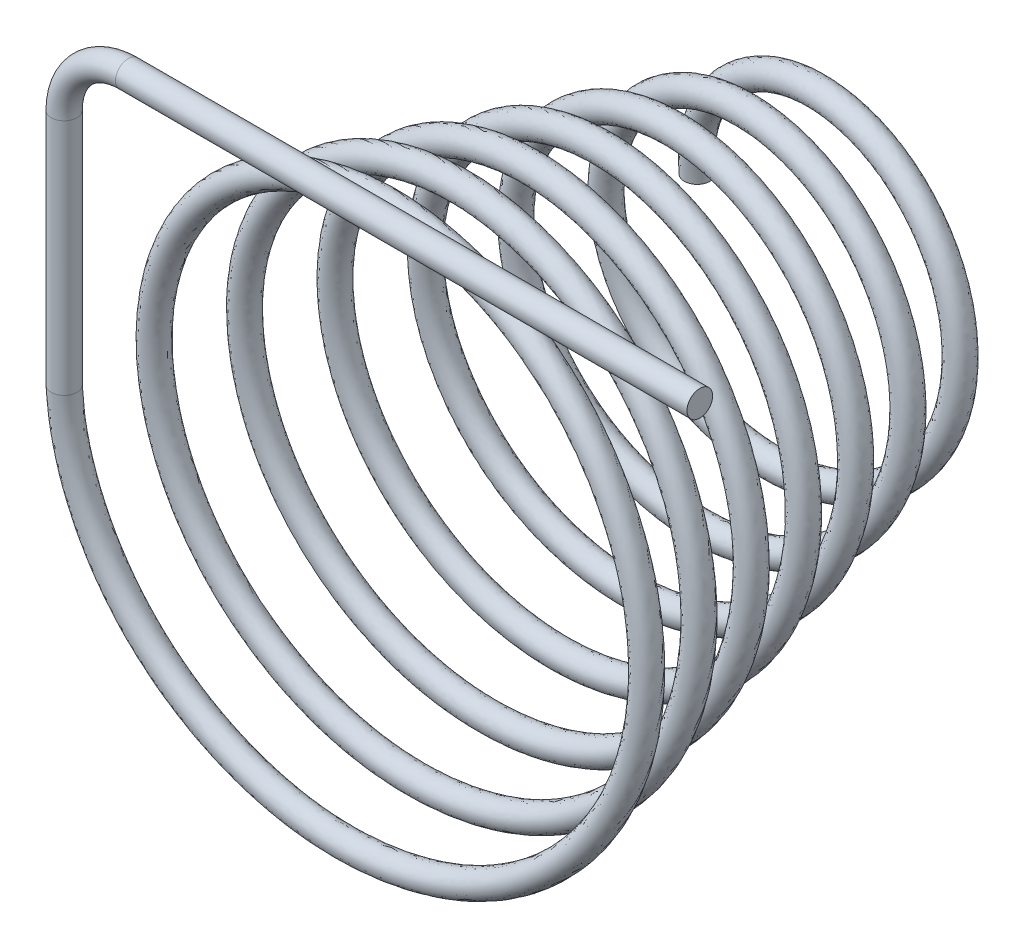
ISO-10303-21;
HEADER;
FILE_DESCRIPTION(('STEP AP214'),'2;1');
FILE_NAME('part.step','',(''),(''),'','','');
FILE_SCHEMA(('AUTOMOTIVE_DESIGN { 1 0 10303 214 1 1 1 1 }'));
ENDSEC;
DATA;
#1=APPLICATION_CONTEXT('core data for automotive mechanical design processes');
#2=APPLICATION_PROTOCOL_DEFINITION('international standard','automotive_design',2000,#1);
#3=PRODUCT_CONTEXT('',#1,'mechanical');
#4=PRODUCT('Part','Part','',(#3));
#5=PRODUCT_RELATED_PRODUCT_CATEGORY('part','',(#4));
#6=PRODUCT_DEFINITION_FORMATION('','',#4);
#7=PRODUCT_DEFINITION_CONTEXT('part definition',#1,'design');
#8=PRODUCT_DEFINITION('design','',#6,#7);
#9=PRODUCT_DEFINITION_SHAPE('','',#8);
#10=(LENGTH_UNIT() NAMED_UNIT(*) SI_UNIT(.MILLI.,.METRE.));
#11=(NAMED_UNIT(*) PLANE_ANGLE_UNIT() SI_UNIT($,.RADIAN.));
#12=(NAMED_UNIT(*) SI_UNIT($,.STERADIAN.) SOLID_ANGLE_UNIT());
#13=UNCERTAINTY_MEASURE_WITH_UNIT(LENGTH_MEASURE(1.E-05),#10,'distance_accuracy_value','');
#14=(GEOMETRIC_REPRESENTATION_CONTEXT(3) GLOBAL_UNCERTAINTY_ASSIGNED_CONTEXT((#13)) GLOBAL_UNIT_ASSIGNED_CONTEXT((#10,
#11,#12)) REPRESENTATION_CONTEXT('',''));
#15=CARTESIAN_POINT('',(0.,0.,0.));
#16=DIRECTION('',(0.,0.,1.));
#17=DIRECTION('',(1.,0.,0.));
#18=AXIS2_PLACEMENT_3D('',#15,#16,#17);
#19=CARTESIAN_POINT('',(-3.37392608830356,-2.78857550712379E-13,-11.6666666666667));
#20=DIRECTION('',(0.,1.,0.));
#21=DIRECTION('',(0.,0.,1.));
#22=AXIS2_PLACEMENT_3D('',#19,#20,#21);
#23=PLANE('',#22);
#24=CARTESIAN_POINT('',(-3.37392608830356,-2.78857550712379E-13,-11.6666666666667));
#25=DIRECTION('',(0.,1.,0.));
#26=DIRECTION('',(0.,0.,1.));
#27=AXIS2_PLACEMENT_3D('',#24,#25,#26);
#28=CIRCLE('',#27,0.3);
#29=CARTESIAN_POINT('',(-3.37392608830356,-2.78857550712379E-13,-11.3666666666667));
#30=VERTEX_POINT('',#29);
#31=EDGE_CURVE('E11',#30,#30,#28,.T.);
#32=ORIENTED_EDGE('',*,*,#31,.F.);
#33=EDGE_LOOP('',(#32));
#34=FACE_BOUND('',#33,.T.);
#35=ADVANCED_FACE('F31',(#34),#23,.F.);
#36=CARTESIAN_POINT('',(-6.5,0.,0.3));
#37=CARTESIAN_POINT('',(-6.48371811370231,-1.48899107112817,0.239236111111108));
#38=CARTESIAN_POINT('',(-5.93689704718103,-2.96055015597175,0.178472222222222));
#39=CARTESIAN_POINT('',(-4.0367236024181,-5.22458877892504,0.056944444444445));
#40=CARTESIAN_POINT('',(-2.69062707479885,-6.00914035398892,-0.00381944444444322));
#41=CARTESIAN_POINT('',(0.19256956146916,-6.5494428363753,-0.125347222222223));
#42=CARTESIAN_POINT('',(1.71911800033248,-6.30369219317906,-0.18611111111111));
#43=CARTESIAN_POINT('',(4.27088760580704,-4.90282008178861,-0.30763888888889));
#44=CARTESIAN_POINT('',(5.28707125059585,-3.75319353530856,-0.368402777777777));
#45=CARTESIAN_POINT('',(6.36234820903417,-1.07215399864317,-0.489930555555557));
#46=CARTESIAN_POINT('',(6.41797243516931,0.449353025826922,-0.550694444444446));
#47=CARTESIAN_POINT('',(5.55483533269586,3.1825585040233,-0.67222222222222));
#48=CARTESIAN_POINT('',(4.6396530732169,4.38447647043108,-0.732986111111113));
#49=CARTESIAN_POINT('',(2.25711865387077,5.93727184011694,-0.854513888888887));
#50=CARTESIAN_POINT('',(0.798670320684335,6.28290446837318,-0.915277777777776));
#51=CARTESIAN_POINT('',(-2.00586621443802,5.97396113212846,-1.03680555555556));
#52=CARTESIAN_POINT('',(-3.34182521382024,5.32097147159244,-1.09756944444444));
#53=CARTESIAN_POINT('',(-5.29794592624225,3.31879966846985,-1.21909722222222));
#54=CARTESIAN_POINT('',(-5.91134141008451,1.9772122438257,-1.27986111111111));
#55=CARTESIAN_POINT('',(-6.15108537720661,-0.7891669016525,-1.40138888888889));
#56=CARTESIAN_POINT('',(-5.77702949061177,-2.20387617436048,-1.46215277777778));
#57=CARTESIAN_POINT('',(-4.21981438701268,-4.47580135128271,-1.58368055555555));
#58=CARTESIAN_POINT('',(-3.04269371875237,-5.32503439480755,-1.64444444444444));
#59=CARTESIAN_POINT('',(-0.419070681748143,-6.08687345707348,-1.76597222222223));
#60=CARTESIAN_POINT('',(1.01777724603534,-5.9971630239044,-1.82673611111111));
#61=CARTESIAN_POINT('',(3.5084961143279,-4.93022750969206,-1.94826388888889));
#62=CARTESIAN_POINT('',(4.55350953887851,-3.95730542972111,-2.00902777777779));
#63=CARTESIAN_POINT('',(5.79145553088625,-1.57219360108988,-2.13055555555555));
#64=CARTESIAN_POINT('',(5.98030921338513,-0.168877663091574,-2.19131944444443));
#65=CARTESIAN_POINT('',(5.42852124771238,2.43823513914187,-2.31284722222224));
#66=CARTESIAN_POINT('',(4.69034022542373,3.63266446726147,-2.37361111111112));
#67=CARTESIAN_POINT('',(2.62716608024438,5.28374276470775,-2.49513888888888));
#68=CARTESIAN_POINT('',(1.30995498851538,5.73476304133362,-2.55590277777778));
#69=CARTESIAN_POINT('',(-1.30995498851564,5.70220000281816,-2.67743055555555));
#70=CARTESIAN_POINT('',(-2.60314866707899,5.21920251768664,-2.73819444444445));
#71=CARTESIAN_POINT('',(-4.5904101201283,3.54617422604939,-2.85972222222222));
#72=CARTESIAN_POINT('',(-5.27756467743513,2.36257480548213,-2.92048611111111));
#73=CARTESIAN_POINT('',(-5.74801487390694,-0.169450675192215,-3.04201388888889));
#74=CARTESIAN_POINT('',(-5.5300623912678,-1.50859913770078,-3.10277777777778));
#75=CARTESIAN_POINT('',(-4.29797435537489,-3.74459594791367,-3.22430555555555));
#76=CARTESIAN_POINT('',(-3.28872136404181,-4.63355241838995,-3.28506944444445));
#77=CARTESIAN_POINT('',(-0.938477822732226,-5.57180918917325,-3.40659722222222));
#78=CARTESIAN_POINT('',(0.393806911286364,-5.61813752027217,-3.4673611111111));
#79=CARTESIAN_POINT('',(2.78437894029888,-4.85893713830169,-3.5888888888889));
#80=CARTESIAN_POINT('',(3.83412884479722,-4.05661040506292,-3.64965277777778));
#81=CARTESIAN_POINT('',(5.18800173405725,-1.97178451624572,-3.77118055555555));
#82=CARTESIAN_POINT('',(5.48760164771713,-0.69710908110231,-3.83194444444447));
#83=CARTESIAN_POINT('',(5.21375344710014,1.75110056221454,-3.95347222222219));
#84=CARTESIAN_POINT('',(4.64176430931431,2.91579834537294,-4.01423611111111));
#85=CARTESIAN_POINT('',(2.89277280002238,4.61873876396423,-4.13576388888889));
#86=CARTESIAN_POINT('',(1.72244659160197,5.15113372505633,-4.19652777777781));
#87=CARTESIAN_POINT('',(-0.687605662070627,5.35578255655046,-4.31805555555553));
#88=CARTESIAN_POINT('',(-1.9185420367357,5.02775938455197,-4.37881944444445));
#89=CARTESIAN_POINT('',(-3.8927586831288,3.66946676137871,-4.50034722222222));
#90=CARTESIAN_POINT('',(-4.6291362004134,2.64451415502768,-4.56111111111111));
#91=CARTESIAN_POINT('',(-5.28703854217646,0.363524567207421,-4.68263888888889));
#92=CARTESIAN_POINT('',(-5.20662400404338,-0.884101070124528,-4.74340277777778));
#93=CARTESIAN_POINT('',(-4.27670867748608,-3.04402394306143,-4.86493055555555));
#94=CARTESIAN_POINT('',(-3.43101377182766,-3.94866381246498,-4.92569444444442));
#95=CARTESIAN_POINT('',(-1.36167473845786,-5.01782572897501,-5.04722222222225));
#96=CARTESIAN_POINT('',(-0.145758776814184,-5.17888125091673,-5.10798611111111));
#97=CARTESIAN_POINT('',(2.11018286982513,-4.69694557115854,-5.22951388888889));
#98=CARTESIAN_POINT('',(3.14211509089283,-4.05616156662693,-5.29027777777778));
#99=CARTESIAN_POINT('',(4.56604823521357,-2.26976459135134,-5.41180555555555));
#100=CARTESIAN_POINT('',(4.95324456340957,-1.13092948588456,-5.47256944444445));
#101=CARTESIAN_POINT('',(4.92068152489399,1.13092948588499,-5.59409722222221));
#102=CARTESIAN_POINT('',(4.50150798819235,2.24574717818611,-5.65486111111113));
#103=CARTESIAN_POINT('',(3.05562484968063,3.95623146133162,-5.77638888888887));
#104=CARTESIAN_POINT('',(2.03452253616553,4.54598900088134,-5.83715277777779));
#105=CARTESIAN_POINT('',(-0.146331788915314,4.94658691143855,-5.95868055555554));
#106=CARTESIAN_POINT('',(-1.29808027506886,4.75643258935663,-6.01944444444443));
#107=CARTESIAN_POINT('',(-3.21830429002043,3.69312862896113,-6.14097222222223));
#108=CARTESIAN_POINT('',(-3.98003358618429,2.82424919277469,-6.2017361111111));
#109=CARTESIAN_POINT('',(-4.78127016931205,0.804801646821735,-6.3232638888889));
#110=CARTESIAN_POINT('',(-4.81830260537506,-0.338260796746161,-6.38402777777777));
#111=CARTESIAN_POINT('',(-4.16303894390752,-2.38619937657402,-6.50555555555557));
#112=CARTESIAN_POINT('',(-3.4735677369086,-3.2837812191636,-6.56631944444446));
#113=CARTESIAN_POINT('',(-1.68645037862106,-4.43873162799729,-6.68784722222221));
#114=CARTESIAN_POINT('',(-0.595547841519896,-4.69229882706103,-6.74861111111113));
#115=CARTESIAN_POINT('',(1.49633490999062,-4.45354576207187,-6.87013888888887));
#116=CARTESIAN_POINT('',(2.48977147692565,-3.96255714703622,-6.93090277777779));
#117=CARTESIAN_POINT('',(3.93953160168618,-2.46674593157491,-7.05243055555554));
#118=CARTESIAN_POINT('',(4.39092604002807,-1.46768093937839,-7.11319444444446));
#119=CARTESIAN_POINT('',(4.56047973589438,0.586044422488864,-7.23472222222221));
#120=CARTESIAN_POINT('',(4.27848927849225,1.63320789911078,-7.2954861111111));
#121=CARTESIAN_POINT('',(3.11911913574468,3.309716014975,-7.4170138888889));
#122=CARTESIAN_POINT('',(2.24633459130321,3.93323800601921,-7.47777777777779));
#123=CARTESIAN_POINT('',(0.307978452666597,4.48720362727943,-7.59930555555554));
#124=CARTESIAN_POINT('',(-0.750424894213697,4.41608498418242,-7.66006944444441));
#125=CARTESIAN_POINT('',(-2.57955177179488,3.62318984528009,-7.78159722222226));
#126=CARTESIAN_POINT('',(-3.34381808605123,2.9047221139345,-7.84236111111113));
#127=CARTESIAN_POINT('',(-4.24419592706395,1.15115587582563,-7.96388888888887));
#128=CARTESIAN_POINT('',(-4.3774532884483,0.122639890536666,-8.02465277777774));
#129=CARTESIAN_POINT('',(-3.96536989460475,-1.78213060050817,-8.14618055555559));
#130=CARTESIAN_POINT('',(-3.42198290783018,-2.65156571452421,-8.20694444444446));
#131=CARTESIAN_POINT('',(-1.91236310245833,-3.8483537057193,-8.32847222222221));
#132=CARTESIAN_POINT('',(-0.951903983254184,-4.17172608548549,-8.38923611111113));
#133=CARTESIAN_POINT('',(0.951903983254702,-4.13916304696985,-8.51076388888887));
#134=CARTESIAN_POINT('',(1.88834568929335,-3.78381345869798,-8.57152777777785));
#135=CARTESIAN_POINT('',(3.32205280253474,-2.56507547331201,-8.69305555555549));
#136=CARTESIAN_POINT('',(3.81441332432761,-1.70647026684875,-8.75381944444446));
#137=CARTESIAN_POINT('',(4.14515894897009,0.123212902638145,-8.87534722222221));
#138=CARTESIAN_POINT('',(3.98280278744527,1.08756141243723,-8.93611111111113));
#139=CARTESIAN_POINT('',(3.08828290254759,2.69201263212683,-9.05763888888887));
#140=CARTESIAN_POINT('',(2.35977702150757,3.32651475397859,-9.11840277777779));
#141=CARTESIAN_POINT('',(0.671125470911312,3.99073114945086,-9.23993055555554));
#142=CARTESIAN_POINT('',(-0.282714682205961,4.01846769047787,-9.30069444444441));
#143=CARTESIAN_POINT('',(-1.98801981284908,3.46714074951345,-9.42222222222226));
#144=CARTESIAN_POINT('',(-2.73343359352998,2.89052506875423,-9.48298611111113));
#145=CARTESIAN_POINT('',(-3.68946152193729,1.40111624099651,-9.60451388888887));
#146=CARTESIAN_POINT('',(-3.89699600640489,0.493986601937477,-9.66527777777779));
#147=CARTESIAN_POINT('',(-3.69333807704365,-1.24156925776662,-9.78680555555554));
#148=CARTESIAN_POINT('',(-3.28334998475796,-2.06374460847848,-9.84756944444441));
#149=CARTESIAN_POINT('',(-2.04071906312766,-3.26032443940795,-9.96909722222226));
#150=CARTESIAN_POINT('',(-1.21291528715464,-3.63071835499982,-10.0298611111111));
#151=CARTESIAN_POINT('',(0.484483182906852,-3.76517691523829,-10.1513888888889));
#152=CARTESIAN_POINT('',(1.34787376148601,-3.52921917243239,-10.2121527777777));
#153=CARTESIAN_POINT('',(2.72667334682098,-2.56877151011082,-10.3336805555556));
#154=CARTESIAN_POINT('',(3.23733981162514,-1.84815502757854,-10.3944444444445));
#155=CARTESIAN_POINT('',(3.68736871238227,-0.252432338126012,-10.5159722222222));
#156=CARTESIAN_POINT('',(3.62554596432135,0.616748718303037,-10.5767361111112));
#157=CARTESIAN_POINT('',(2.96967101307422,2.11507960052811,-10.6982638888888));
#158=CARTESIAN_POINT('',(2.37843045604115,2.73897235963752,-10.7590277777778));
#159=CARTESIAN_POINT('',(0.940637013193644,3.47056612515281,-10.8805555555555));
#160=CARTESIAN_POINT('',(0.0995210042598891,3.57602532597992,-10.9413194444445));
#161=CARTESIAN_POINT('',(-1.4540783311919,3.23379421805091,-11.0628472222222));
#162=CARTESIAN_POINT('',(-2.16101633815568,2.78780424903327,-11.1236111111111));
#163=CARTESIAN_POINT('',(-3.13065917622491,1.5549616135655,-11.2451388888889));
#164=CARTESIAN_POINT('',(-3.3902079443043,0.772883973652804,-11.3059027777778));
#165=CARTESIAN_POINT('',(-3.37392608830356,-2.78857550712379E-13,-11.3666666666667));
#166=CARTESIAN_POINT('',(-5.9,0.,0.3));
#167=CARTESIAN_POINT('',(-5.88371811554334,-1.35154574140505,0.239236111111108));
#168=CARTESIAN_POINT('',(-5.38589700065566,-2.68616010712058,0.178472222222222));
#169=CARTESIAN_POINT('',(-3.66011110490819,-4.73770688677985,0.056944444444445));
#170=CARTESIAN_POINT('',(-2.43876948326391,-5.44748324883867,-0.00381944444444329));
#171=CARTESIAN_POINT('',(0.174820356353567,-5.93415760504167,-0.125347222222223));
#172=CARTESIAN_POINT('',(1.55749505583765,-5.70974861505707,-0.18611111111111));
#173=CARTESIAN_POINT('',(3.86683446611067,-4.43845814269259,-0.30763888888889));
#174=CARTESIAN_POINT('',(4.78534120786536,-3.39660145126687,-0.368402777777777));
#175=CARTESIAN_POINT('',(5.75542281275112,-0.969525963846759,-0.489930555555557));
#176=CARTESIAN_POINT('',(5.80391024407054,0.406708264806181,-0.550694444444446));
#177=CARTESIAN_POINT('',(5.02056912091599,2.87686165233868,-0.67222222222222));
#178=CARTESIAN_POINT('',(4.19203013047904,3.96195469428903,-0.732986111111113));
#179=CARTESIAN_POINT('',(2.03805731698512,5.36203008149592,-0.854513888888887));
#180=CARTESIAN_POINT('',(0.720698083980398,5.6723217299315,-0.915277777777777));
#181=CARTESIAN_POINT('',(-1.8102734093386,5.39032219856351,-1.03680555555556));
#182=CARTESIAN_POINT('',(-3.01474897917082,4.79951956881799,-1.09756944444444));
#183=CARTESIAN_POINT('',(-4.77649402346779,2.99172343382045,-1.21909722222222));
#184=CARTESIAN_POINT('',(-5.32770247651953,1.78161943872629,-1.27986111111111));
#185=CARTESIAN_POINT('',(-5.54050263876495,-0.711194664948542,-1.40138888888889));
#186=CARTESIAN_POINT('',(-5.20178773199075,-1.98481483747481,-1.46215277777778));
#187=CARTESIAN_POINT('',(-3.79729261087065,-4.02817840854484,-1.58368055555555));
#188=CARTESIAN_POINT('',(-2.73699686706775,-4.79076818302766,-1.64444444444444));
#189=CARTESIAN_POINT('',(-0.37642592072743,-5.47281126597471,-1.76597222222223));
#190=CARTESIAN_POINT('',(0.915149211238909,-5.39023762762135,-1.82673611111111));
#191=CARTESIAN_POINT('',(3.1519040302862,-4.42849746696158,-1.94826388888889));
#192=CARTESIAN_POINT('',(4.08914759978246,-3.55325229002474,-2.00902777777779));
#193=CARTESIAN_POINT('',(5.19751195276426,-1.41057065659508,-2.13055555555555));
#194=CARTESIAN_POINT('',(5.36502398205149,-0.151128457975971,-2.19131944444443));
#195=CARTESIAN_POINT('',(4.86686414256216,2.18637754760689,-2.31284722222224));
#196=CARTESIAN_POINT('',(4.20345833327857,3.25605196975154,-2.37361111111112));
#197=CARTESIAN_POINT('',(2.35277603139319,4.73274271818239,-2.49513888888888));
#198=CARTESIAN_POINT('',(1.17251063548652,5.13476304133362,-2.55590277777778));
#199=CARTESIAN_POINT('',(-1.17251063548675,5.10220000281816,-2.67743055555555));
#200=CARTESIAN_POINT('',(-2.32875861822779,4.66820247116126,-2.73819444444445));
#201=CARTESIAN_POINT('',(-4.1035282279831,3.1695617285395,-2.85972222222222));
#202=CARTESIAN_POINT('',(-4.71590757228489,2.1107172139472,-2.92048611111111));
#203=CARTESIAN_POINT('',(-5.13272964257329,-0.151701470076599,-3.04201388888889));
#204=CARTESIAN_POINT('',(-4.93611881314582,-1.3469761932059,-3.10277777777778));
#205=CARTESIAN_POINT('',(-3.83361241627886,-3.34054280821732,-3.22430555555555));
#206=CARTESIAN_POINT('',(-2.93212928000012,-4.13182237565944,-3.28506944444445));
#207=CARTESIAN_POINT('',(-0.835849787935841,-4.9648837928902,-3.40659722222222));
#208=CARTESIAN_POINT('',(0.35116215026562,-5.00407532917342,-3.4673611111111));
#209=CARTESIAN_POINT('',(2.47868208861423,-4.3246709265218,-3.5888888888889));
#210=CARTESIAN_POINT('',(3.41160706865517,-3.60898746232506,-3.64965277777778));
#211=CARTESIAN_POINT('',(4.61275997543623,-1.7527231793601,-3.77118055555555));
#212=CARTESIAN_POINT('',(4.87701890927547,-0.619136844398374,-3.83194444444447));
#213=CARTESIAN_POINT('',(4.63011451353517,1.55550775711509,-3.95347222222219));
#214=CARTESIAN_POINT('',(4.12031240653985,2.58872211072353,-4.01423611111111));
#215=CARTESIAN_POINT('',(2.56569656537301,4.09728686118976,-4.13576388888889));
#216=CARTESIAN_POINT('',(1.52685378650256,4.56749479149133,-4.19652777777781));
#217=CARTESIAN_POINT('',(-0.609633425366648,4.74519981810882,-4.31805555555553));
#218=CARTESIAN_POINT('',(-1.69948069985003,4.45251762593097,-4.37881944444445));
#219=CARTESIAN_POINT('',(-3.44513574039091,3.24694498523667,-4.50034722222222));
#220=CARTESIAN_POINT('',(-4.0948699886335,2.33881730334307,-4.56111111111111));
#221=CARTESIAN_POINT('',(-4.67297635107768,0.320879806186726,-4.68263888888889));
#222=CARTESIAN_POINT('',(-4.59969860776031,-0.781473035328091,-4.74340277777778));
#223=CARTESIAN_POINT('',(-3.77497863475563,-2.68743185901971,-4.86493055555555));
#224=CARTESIAN_POINT('',(-3.0269606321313,-3.48430187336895,-4.92569444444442));
#225=CARTESIAN_POINT('',(-1.20005179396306,-4.42388215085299,-5.04722222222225));
#226=CARTESIAN_POINT('',(-0.128009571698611,-4.5635960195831,-5.10798611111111));
#227=CARTESIAN_POINT('',(1.85832527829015,-4.13528846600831,-5.22951388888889));
#228=CARTESIAN_POINT('',(2.76550259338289,-3.56927967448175,-5.29027777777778));
#229=CARTESIAN_POINT('',(4.01504818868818,-1.99537454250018,-5.41180555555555));
#230=CARTESIAN_POINT('',(4.35324456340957,-0.993485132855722,-5.47256944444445));
#231=CARTESIAN_POINT('',(4.32068152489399,0.993485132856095,-5.59409722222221));
#232=CARTESIAN_POINT('',(3.95050794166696,1.97135712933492,-5.65486111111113));
#233=CARTESIAN_POINT('',(2.67901235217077,3.46934956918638,-5.77638888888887));
#234=CARTESIAN_POINT('',(1.78266494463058,3.98433189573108,-5.83715277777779));
#235=CARTESIAN_POINT('',(-0.128582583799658,4.33130168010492,-5.95868055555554));
#236=CARTESIAN_POINT('',(-1.13645733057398,4.16248901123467,-6.01944444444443));
#237=CARTESIAN_POINT('',(-2.81425115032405,3.22876668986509,-6.14097222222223));
#238=CARTESIAN_POINT('',(-3.47830354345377,2.46765710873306,-6.2017361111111));
#239=CARTESIAN_POINT('',(-4.17434477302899,0.702173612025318,-6.3232638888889));
#240=CARTESIAN_POINT('',(-4.2042404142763,-0.295616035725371,-6.38402777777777));
#241=CARTESIAN_POINT('',(-3.62877273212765,-2.08050252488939,-6.50555555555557));
#242=CARTESIAN_POINT('',(-3.02594479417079,-2.86125944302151,-6.56631944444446));
#243=CARTESIAN_POINT('',(-1.46738904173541,-3.86348986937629,-6.68784722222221));
#244=CARTESIAN_POINT('',(-0.51757560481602,-4.08171608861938,-6.74861111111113));
#245=CARTESIAN_POINT('',(1.3007421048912,-3.86990682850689,-6.87013888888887));
#246=CARTESIAN_POINT('',(2.16269524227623,-3.44110524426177,-6.93090277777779));
#247=CARTESIAN_POINT('',(3.41807969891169,-2.13966969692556,-7.05243055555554));
#248=CARTESIAN_POINT('',(3.80728710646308,-1.27208813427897,-7.11319444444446));
#249=CARTESIAN_POINT('',(3.94989699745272,0.508072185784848,-7.23472222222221));
#250=CARTESIAN_POINT('',(3.70324751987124,1.41414656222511,-7.2954861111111));
#251=CARTESIAN_POINT('',(2.69659735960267,2.86209307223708,-7.4170138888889));
#252=CARTESIAN_POINT('',(1.94063773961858,3.39897179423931,-7.47777777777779));
#253=CARTESIAN_POINT('',(0.265333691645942,3.87314143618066,-7.59930555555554));
#254=CARTESIAN_POINT('',(-0.647796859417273,3.80915958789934,-7.66006944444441));
#255=CARTESIAN_POINT('',(-2.22295968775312,3.12145980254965,-7.78159722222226));
#256=CARTESIAN_POINT('',(-2.87945614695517,2.50066897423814,-7.84236111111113));
#257=CARTESIAN_POINT('',(-3.65025234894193,0.989532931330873,-7.96388888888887));
#258=CARTESIAN_POINT('',(-3.76216805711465,0.104890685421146,-8.02465277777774));
#259=CARTESIAN_POINT('',(-3.40371278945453,-1.53027300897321,-8.14618055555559));
#260=CARTESIAN_POINT('',(-2.93510101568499,-2.2749532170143,-8.20694444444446));
#261=CARTESIAN_POINT('',(-1.6379730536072,-3.29735365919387,-8.32847222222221));
#262=CARTESIAN_POINT('',(-0.814459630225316,-3.57172608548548,-8.38923611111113));
#263=CARTESIAN_POINT('',(0.814459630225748,-3.53916304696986,-8.51076388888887));
#264=CARTESIAN_POINT('',(1.61395564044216,-3.23281341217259,-8.57152777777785));
#265=CARTESIAN_POINT('',(2.83517091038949,-2.18846297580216,-8.69305555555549));
#266=CARTESIAN_POINT('',(3.25275621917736,-1.45461267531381,-8.75381944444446));
#267=CARTESIAN_POINT('',(3.52987371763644,0.105463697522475,-8.87534722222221));
#268=CARTESIAN_POINT('',(3.38885920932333,0.925938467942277,-8.93611111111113));
#269=CARTESIAN_POINT('',(2.62392096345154,2.28795949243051,-9.05763888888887));
#270=CARTESIAN_POINT('',(2.00318493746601,2.82478471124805,-9.11840277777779));
#271=CARTESIAN_POINT('',(0.568497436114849,3.38380575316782,-9.23993055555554));
#272=CARTESIAN_POINT('',(-0.240069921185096,3.40440549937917,-9.30069444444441));
#273=CARTESIAN_POINT('',(-1.6823229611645,2.93287453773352,-9.42222222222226));
#274=CARTESIAN_POINT('',(-2.31091181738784,2.44290212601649,-9.48298611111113));
#275=CARTESIAN_POINT('',(-3.11421976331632,1.18205490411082,-9.60451388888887));
#276=CARTESIAN_POINT('',(-3.28641326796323,0.416014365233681,-9.66527777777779));
#277=CARTESIAN_POINT('',(-3.10969914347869,-1.04597645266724,-9.78680555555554));
#278=CARTESIAN_POINT('',(-2.76189808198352,-1.73666837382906,-9.84756944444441));
#279=CARTESIAN_POINT('',(-1.71364282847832,-2.73887253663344,-9.96909722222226));
#280=CARTESIAN_POINT('',(-1.01732248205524,-3.04707942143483,-10.0298611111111));
#281=CARTESIAN_POINT('',(0.40651094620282,-3.15459417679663,-10.1513888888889));
#282=CARTESIAN_POINT('',(1.12881242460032,-2.95397741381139,-10.2121527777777));
#283=CARTESIAN_POINT('',(2.27905040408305,-2.14624973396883,-10.3336805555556));
#284=CARTESIAN_POINT('',(2.70307359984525,-1.54245817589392,-10.3944444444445));
#285=CARTESIAN_POINT('',(3.07330652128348,-0.209787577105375,-10.5159722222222));
#286=CARTESIAN_POINT('',(3.01862056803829,0.514120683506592,-10.5767361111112));
#287=CARTESIAN_POINT('',(2.46794097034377,1.75848751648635,-10.6982638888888));
#288=CARTESIAN_POINT('',(1.97437731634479,2.27461042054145,-10.7590277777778));
#289=CARTESIAN_POINT('',(0.779014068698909,2.8766225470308,-10.8805555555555));
#290=CARTESIAN_POINT('',(0.0817717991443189,2.96074009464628,-10.9413194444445));
#291=CARTESIAN_POINT('',(-1.20222073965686,2.6721371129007,-11.0628472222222));
#292=CARTESIAN_POINT('',(-1.78440384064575,2.30092235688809,-11.1236111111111));
#293=CARTESIAN_POINT('',(-2.57965912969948,1.28057156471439,-11.2451388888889));
#294=CARTESIAN_POINT('',(-2.79020794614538,0.635438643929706,-11.3059027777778));
#295=CARTESIAN_POINT('',(-2.77392608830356,-2.20200630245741E-13,-11.3666666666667));
#296=CARTESIAN_POINT('',(-5.9,0.,-0.3));
#297=CARTESIAN_POINT('',(-5.8837181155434,-1.35154574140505,-0.360763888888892));
#298=CARTESIAN_POINT('',(-5.38589700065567,-2.68616010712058,-0.421527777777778));
#299=CARTESIAN_POINT('',(-3.66011110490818,-4.73770688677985,-0.543055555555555));
#300=CARTESIAN_POINT('',(-2.43876948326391,-5.44748324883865,-0.603819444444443));
#301=CARTESIAN_POINT('',(0.174820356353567,-5.9341576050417,-0.725347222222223));
#302=CARTESIAN_POINT('',(1.55749505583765,-5.70974861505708,-0.78611111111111));
#303=CARTESIAN_POINT('',(3.86683446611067,-4.43845814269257,-0.90763888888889));
#304=CARTESIAN_POINT('',(4.78534120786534,-3.39660145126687,-0.968402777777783));
#305=CARTESIAN_POINT('',(5.75542281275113,-0.969525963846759,-1.08993055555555));
#306=CARTESIAN_POINT('',(5.80391024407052,0.406708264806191,-1.15069444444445));
#307=CARTESIAN_POINT('',(5.020569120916,2.87686165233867,-1.27222222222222));
#308=CARTESIAN_POINT('',(4.19203013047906,3.96195469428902,-1.33298611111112));
#309=CARTESIAN_POINT('',(2.03805731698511,5.36203008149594,-1.45451388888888));
#310=CARTESIAN_POINT('',(0.720698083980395,5.6723217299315,-1.51527777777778));
#311=CARTESIAN_POINT('',(-1.81027340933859,5.39032219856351,-1.63680555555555));
#312=CARTESIAN_POINT('',(-3.01474897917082,4.79951956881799,-1.69756944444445));
#313=CARTESIAN_POINT('',(-4.7764940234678,2.99172343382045,-1.81909722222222));
#314=CARTESIAN_POINT('',(-5.32770247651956,1.78161943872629,-1.87986111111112));
#315=CARTESIAN_POINT('',(-5.54050263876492,-0.711194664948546,-2.00138888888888));
#316=CARTESIAN_POINT('',(-5.20178773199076,-1.98481483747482,-2.06215277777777));
#317=CARTESIAN_POINT('',(-3.79729261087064,-4.02817840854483,-2.18368055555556));
#318=CARTESIAN_POINT('',(-2.73699686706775,-4.79076818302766,-2.24444444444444));
#319=CARTESIAN_POINT('',(-0.376425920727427,-5.47281126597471,-2.36597222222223));
#320=CARTESIAN_POINT('',(0.915149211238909,-5.39023762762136,-2.42673611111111));
#321=CARTESIAN_POINT('',(3.1519040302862,-4.42849746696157,-2.54826388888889));
#322=CARTESIAN_POINT('',(4.08914759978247,-3.55325229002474,-2.60902777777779));
#323=CARTESIAN_POINT('',(5.19751195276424,-1.41057065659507,-2.73055555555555));
#324=CARTESIAN_POINT('',(5.3650239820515,-0.151128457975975,-2.79131944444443));
#325=CARTESIAN_POINT('',(4.86686414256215,2.1863775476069,-2.91284722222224));
#326=CARTESIAN_POINT('',(4.20345833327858,3.25605196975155,-2.97361111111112));
#327=CARTESIAN_POINT('',(2.35277603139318,4.73274271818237,-3.09513888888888));
#328=CARTESIAN_POINT('',(1.17251063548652,5.13476304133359,-3.15590277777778));
#329=CARTESIAN_POINT('',(-1.17251063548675,5.10220000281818,-3.27743055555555));
#330=CARTESIAN_POINT('',(-2.32875861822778,4.66820247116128,-3.33819444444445));
#331=CARTESIAN_POINT('',(-4.10352822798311,3.16956172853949,-3.45972222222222));
#332=CARTESIAN_POINT('',(-4.71590757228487,2.11071721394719,-3.52048611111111));
#333=CARTESIAN_POINT('',(-5.13272964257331,-0.151701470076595,-3.64201388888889));
#334=CARTESIAN_POINT('',(-4.93611881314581,-1.3469761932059,-3.70277777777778));
#335=CARTESIAN_POINT('',(-3.83361241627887,-3.34054280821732,-3.82430555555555));
#336=CARTESIAN_POINT('',(-2.93212928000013,-4.13182237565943,-3.88506944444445));
#337=CARTESIAN_POINT('',(-0.835849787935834,-4.96488379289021,-4.00659722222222));
#338=CARTESIAN_POINT('',(0.351162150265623,-5.00407532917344,-4.06736111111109));
#339=CARTESIAN_POINT('',(2.47868208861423,-4.32467092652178,-4.18888888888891));
#340=CARTESIAN_POINT('',(3.41160706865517,-3.60898746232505,-4.24965277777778));
#341=CARTESIAN_POINT('',(4.61275997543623,-1.7527231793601,-4.37118055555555));
#342=CARTESIAN_POINT('',(4.87701890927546,-0.619136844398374,-4.43194444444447));
#343=CARTESIAN_POINT('',(4.63011451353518,1.55550775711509,-4.55347222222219));
#344=CARTESIAN_POINT('',(4.12031240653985,2.58872211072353,-4.61423611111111));
#345=CARTESIAN_POINT('',(2.56569656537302,4.09728686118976,-4.73576388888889));
#346=CARTESIAN_POINT('',(1.52685378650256,4.56749479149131,-4.79652777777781));
#347=CARTESIAN_POINT('',(-0.609633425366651,4.74519981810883,-4.91805555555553));
#348=CARTESIAN_POINT('',(-1.69948069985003,4.452517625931,-4.97881944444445));
#349=CARTESIAN_POINT('',(-3.44513574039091,3.24694498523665,-5.10034722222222));
#350=CARTESIAN_POINT('',(-4.09486998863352,2.33881730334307,-5.16111111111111));
#351=CARTESIAN_POINT('',(-4.67297635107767,0.32087980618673,-5.28263888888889));
#352=CARTESIAN_POINT('',(-4.59969860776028,-0.781473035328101,-5.34340277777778));
#353=CARTESIAN_POINT('',(-3.77497863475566,-2.6874318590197,-5.46493055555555));
#354=CARTESIAN_POINT('',(-3.0269606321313,-3.48430187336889,-5.52569444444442));
#355=CARTESIAN_POINT('',(-1.20005179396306,-4.42388215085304,-5.64722222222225));
#356=CARTESIAN_POINT('',(-0.12800957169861,-4.56359601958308,-5.70798611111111));
#357=CARTESIAN_POINT('',(1.85832527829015,-4.13528846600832,-5.82951388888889));
#358=CARTESIAN_POINT('',(2.76550259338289,-3.56927967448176,-5.89027777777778));
#359=CARTESIAN_POINT('',(4.01504818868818,-1.99537454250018,-6.01180555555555));
#360=CARTESIAN_POINT('',(4.35324456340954,-0.993485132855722,-6.07256944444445));
#361=CARTESIAN_POINT('',(4.32068152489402,0.993485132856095,-6.19409722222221));
#362=CARTESIAN_POINT('',(3.95050794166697,1.97135712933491,-6.25486111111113));
#363=CARTESIAN_POINT('',(2.67901235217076,3.46934956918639,-6.37638888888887));
#364=CARTESIAN_POINT('',(1.78266494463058,3.9843318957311,-6.43715277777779));
#365=CARTESIAN_POINT('',(-0.128582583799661,4.3313016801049,-6.55868055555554));
#366=CARTESIAN_POINT('',(-1.13645733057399,4.16248901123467,-6.61944444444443));
#367=CARTESIAN_POINT('',(-2.81425115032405,3.2287666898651,-6.74097222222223));
#368=CARTESIAN_POINT('',(-3.47830354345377,2.46765710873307,-6.8017361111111));
#369=CARTESIAN_POINT('',(-4.17434477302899,0.702173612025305,-6.9232638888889));
#370=CARTESIAN_POINT('',(-4.20424041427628,-0.295616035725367,-6.98402777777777));
#371=CARTESIAN_POINT('',(-3.62877273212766,-2.08050252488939,-7.10555555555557));
#372=CARTESIAN_POINT('',(-3.02594479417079,-2.86125944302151,-7.16631944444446));
#373=CARTESIAN_POINT('',(-1.46738904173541,-3.86348986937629,-7.28784722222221));
#374=CARTESIAN_POINT('',(-0.517575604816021,-4.08171608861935,-7.34861111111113));
#375=CARTESIAN_POINT('',(1.3007421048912,-3.86990682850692,-7.47013888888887));
#376=CARTESIAN_POINT('',(2.16269524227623,-3.44110524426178,-7.53090277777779));
#377=CARTESIAN_POINT('',(3.41807969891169,-2.13966969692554,-7.65243055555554));
#378=CARTESIAN_POINT('',(3.80728710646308,-1.27208813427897,-7.71319444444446));
#379=CARTESIAN_POINT('',(3.94989699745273,0.508072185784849,-7.83472222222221));
#380=CARTESIAN_POINT('',(3.70324751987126,1.41414656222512,-7.89548611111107));
#381=CARTESIAN_POINT('',(2.69659735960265,2.86209307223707,-8.01701388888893));
#382=CARTESIAN_POINT('',(1.94063773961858,3.39897179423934,-8.07777777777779));
#383=CARTESIAN_POINT('',(0.265333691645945,3.87314143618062,-8.19930555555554));
#384=CARTESIAN_POINT('',(-0.64779685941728,3.80915958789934,-8.26006944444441));
#385=CARTESIAN_POINT('',(-2.22295968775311,3.12145980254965,-8.38159722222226));
#386=CARTESIAN_POINT('',(-2.87945614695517,2.50066897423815,-8.44236111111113));
#387=CARTESIAN_POINT('',(-3.65025234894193,0.98953293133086,-8.56388888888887));
#388=CARTESIAN_POINT('',(-3.76216805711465,0.104890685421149,-8.62465277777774));
#389=CARTESIAN_POINT('',(-3.40371278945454,-1.53027300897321,-8.74618055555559));
#390=CARTESIAN_POINT('',(-2.935101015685,-2.2749532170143,-8.80694444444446));
#391=CARTESIAN_POINT('',(-1.63797305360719,-3.29735365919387,-8.92847222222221));
#392=CARTESIAN_POINT('',(-0.814459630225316,-3.57172608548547,-8.98923611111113));
#393=CARTESIAN_POINT('',(0.814459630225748,-3.53916304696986,-9.11076388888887));
#394=CARTESIAN_POINT('',(1.61395564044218,-3.23281341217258,-9.17152777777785));
#395=CARTESIAN_POINT('',(2.83517091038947,-2.18846297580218,-9.29305555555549));
#396=CARTESIAN_POINT('',(3.25275621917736,-1.45461267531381,-9.35381944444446));
#397=CARTESIAN_POINT('',(3.52987371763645,0.105463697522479,-9.47534722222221));
#398=CARTESIAN_POINT('',(3.38885920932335,0.925938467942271,-9.53611111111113));
#399=CARTESIAN_POINT('',(2.62392096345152,2.28795949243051,-9.65763888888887));
#400=CARTESIAN_POINT('',(2.003184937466,2.82478471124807,-9.71840277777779));
#401=CARTESIAN_POINT('',(0.568497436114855,3.3838057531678,-9.83993055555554));
#402=CARTESIAN_POINT('',(-0.240069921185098,3.40440549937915,-9.90069444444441));
#403=CARTESIAN_POINT('',(-1.6823229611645,2.93287453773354,-10.0222222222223));
#404=CARTESIAN_POINT('',(-2.31091181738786,2.44290212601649,-10.0829861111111));
#405=CARTESIAN_POINT('',(-3.11421976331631,1.18205490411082,-10.2045138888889));
#406=CARTESIAN_POINT('',(-3.28641326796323,0.41601436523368,-10.2652777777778));
#407=CARTESIAN_POINT('',(-3.10969914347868,-1.04597645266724,-10.3868055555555));
#408=CARTESIAN_POINT('',(-2.76189808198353,-1.73666837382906,-10.4475694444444));
#409=CARTESIAN_POINT('',(-1.71364282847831,-2.73887253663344,-10.5690972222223));
#410=CARTESIAN_POINT('',(-1.01732248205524,-3.04707942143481,-10.6298611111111));
#411=CARTESIAN_POINT('',(0.406510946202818,-3.15459417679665,-10.7513888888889));
#412=CARTESIAN_POINT('',(1.12881242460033,-2.95397741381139,-10.8121527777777));
#413=CARTESIAN_POINT('',(2.27905040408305,-2.14624973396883,-10.9336805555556));
#414=CARTESIAN_POINT('',(2.70307359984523,-1.54245817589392,-10.9944444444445));
#415=CARTESIAN_POINT('',(3.0733065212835,-0.209787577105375,-11.1159722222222));
#416=CARTESIAN_POINT('',(3.01862056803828,0.514120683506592,-11.1767361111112));
#417=CARTESIAN_POINT('',(2.46794097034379,1.75848751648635,-11.2982638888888));
#418=CARTESIAN_POINT('',(1.9743773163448,2.27461042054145,-11.3590277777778));
#419=CARTESIAN_POINT('',(0.779014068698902,2.8766225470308,-11.4805555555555));
#420=CARTESIAN_POINT('',(0.0817717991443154,2.96074009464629,-11.5413194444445));
#421=CARTESIAN_POINT('',(-1.20222073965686,2.67213711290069,-11.6628472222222));
#422=CARTESIAN_POINT('',(-1.78440384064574,2.30092235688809,-11.7236111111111));
#423=CARTESIAN_POINT('',(-2.5796591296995,1.2805715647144,-11.8451388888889));
#424=CARTESIAN_POINT('',(-2.79020794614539,0.635438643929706,-11.9059027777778));
#425=CARTESIAN_POINT('',(-2.77392608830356,-2.20200630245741E-13,-11.9666666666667));
#426=CARTESIAN_POINT('',(-6.5,0.,-0.3));
#427=CARTESIAN_POINT('',(-6.48371811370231,-1.48899107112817,-0.360763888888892));
#428=CARTESIAN_POINT('',(-5.93689704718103,-2.96055015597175,-0.421527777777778));
#429=CARTESIAN_POINT('',(-4.0367236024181,-5.22458877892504,-0.543055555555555));
#430=CARTESIAN_POINT('',(-2.69062707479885,-6.00914035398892,-0.603819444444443));
#431=CARTESIAN_POINT('',(0.19256956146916,-6.5494428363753,-0.725347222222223));
#432=CARTESIAN_POINT('',(1.71911800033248,-6.30369219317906,-0.78611111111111));
#433=CARTESIAN_POINT('',(4.27088760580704,-4.90282008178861,-0.90763888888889));
#434=CARTESIAN_POINT('',(5.28707125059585,-3.75319353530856,-0.968402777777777));
#435=CARTESIAN_POINT('',(6.36234820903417,-1.07215399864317,-1.08993055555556));
#436=CARTESIAN_POINT('',(6.41797243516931,0.449353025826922,-1.15069444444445));
#437=CARTESIAN_POINT('',(5.55483533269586,3.1825585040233,-1.27222222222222));
#438=CARTESIAN_POINT('',(4.6396530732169,4.38447647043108,-1.33298611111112));
#439=CARTESIAN_POINT('',(2.25711865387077,5.93727184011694,-1.45451388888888));
#440=CARTESIAN_POINT('',(0.798670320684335,6.28290446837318,-1.51527777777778));
#441=CARTESIAN_POINT('',(-2.00586621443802,5.97396113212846,-1.63680555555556));
#442=CARTESIAN_POINT('',(-3.34182521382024,5.32097147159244,-1.69756944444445));
#443=CARTESIAN_POINT('',(-5.29794592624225,3.31879966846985,-1.81909722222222));
#444=CARTESIAN_POINT('',(-5.91134141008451,1.9772122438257,-1.87986111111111));
#445=CARTESIAN_POINT('',(-6.15108537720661,-0.7891669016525,-2.00138888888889));
#446=CARTESIAN_POINT('',(-5.77702949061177,-2.20387617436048,-2.06215277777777));
#447=CARTESIAN_POINT('',(-4.21981438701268,-4.47580135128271,-2.18368055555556));
#448=CARTESIAN_POINT('',(-3.04269371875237,-5.32503439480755,-2.24444444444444));
#449=CARTESIAN_POINT('',(-0.419070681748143,-6.08687345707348,-2.36597222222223));
#450=CARTESIAN_POINT('',(1.01777724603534,-5.9971630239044,-2.42673611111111));
#451=CARTESIAN_POINT('',(3.5084961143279,-4.93022750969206,-2.54826388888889));
#452=CARTESIAN_POINT('',(4.55350953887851,-3.95730542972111,-2.60902777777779));
#453=CARTESIAN_POINT('',(5.79145553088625,-1.57219360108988,-2.73055555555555));
#454=CARTESIAN_POINT('',(5.98030921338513,-0.168877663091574,-2.79131944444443));
#455=CARTESIAN_POINT('',(5.42852124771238,2.43823513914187,-2.91284722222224));
#456=CARTESIAN_POINT('',(4.69034022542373,3.63266446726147,-2.97361111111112));
#457=CARTESIAN_POINT('',(2.62716608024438,5.28374276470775,-3.09513888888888));
#458=CARTESIAN_POINT('',(1.30995498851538,5.73476304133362,-3.15590277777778));
#459=CARTESIAN_POINT('',(-1.30995498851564,5.70220000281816,-3.27743055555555));
#460=CARTESIAN_POINT('',(-2.60314866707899,5.21920251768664,-3.33819444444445));
#461=CARTESIAN_POINT('',(-4.5904101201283,3.54617422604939,-3.45972222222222));
#462=CARTESIAN_POINT('',(-5.27756467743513,2.36257480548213,-3.52048611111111));
#463=CARTESIAN_POINT('',(-5.74801487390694,-0.169450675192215,-3.64201388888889));
#464=CARTESIAN_POINT('',(-5.5300623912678,-1.50859913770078,-3.70277777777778));
#465=CARTESIAN_POINT('',(-4.29797435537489,-3.74459594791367,-3.82430555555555));
#466=CARTESIAN_POINT('',(-3.28872136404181,-4.63355241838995,-3.88506944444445));
#467=CARTESIAN_POINT('',(-0.938477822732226,-5.57180918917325,-4.00659722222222));
#468=CARTESIAN_POINT('',(0.393806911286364,-5.61813752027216,-4.06736111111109));
#469=CARTESIAN_POINT('',(2.78437894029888,-4.85893713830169,-4.18888888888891));
#470=CARTESIAN_POINT('',(3.83412884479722,-4.05661040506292,-4.24965277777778));
#471=CARTESIAN_POINT('',(5.18800173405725,-1.97178451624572,-4.37118055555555));
#472=CARTESIAN_POINT('',(5.48760164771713,-0.69710908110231,-4.43194444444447));
#473=CARTESIAN_POINT('',(5.21375344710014,1.75110056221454,-4.55347222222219));
#474=CARTESIAN_POINT('',(4.64176430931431,2.91579834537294,-4.61423611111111));
#475=CARTESIAN_POINT('',(2.89277280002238,4.61873876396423,-4.73576388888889));
#476=CARTESIAN_POINT('',(1.72244659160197,5.15113372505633,-4.79652777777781));
#477=CARTESIAN_POINT('',(-0.687605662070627,5.35578255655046,-4.91805555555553));
#478=CARTESIAN_POINT('',(-1.9185420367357,5.02775938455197,-4.97881944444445));
#479=CARTESIAN_POINT('',(-3.8927586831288,3.66946676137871,-5.10034722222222));
#480=CARTESIAN_POINT('',(-4.6291362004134,2.64451415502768,-5.16111111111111));
#481=CARTESIAN_POINT('',(-5.28703854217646,0.363524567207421,-5.28263888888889));
#482=CARTESIAN_POINT('',(-5.20662400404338,-0.884101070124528,-5.34340277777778));
#483=CARTESIAN_POINT('',(-4.27670867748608,-3.04402394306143,-5.46493055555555));
#484=CARTESIAN_POINT('',(-3.43101377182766,-3.94866381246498,-5.52569444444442));
#485=CARTESIAN_POINT('',(-1.36167473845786,-5.01782572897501,-5.64722222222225));
#486=CARTESIAN_POINT('',(-0.145758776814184,-5.17888125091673,-5.70798611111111));
#487=CARTESIAN_POINT('',(2.11018286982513,-4.69694557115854,-5.82951388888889));
#488=CARTESIAN_POINT('',(3.14211509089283,-4.05616156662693,-5.89027777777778));
#489=CARTESIAN_POINT('',(4.56604823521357,-2.26976459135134,-6.01180555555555));
#490=CARTESIAN_POINT('',(4.95324456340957,-1.13092948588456,-6.07256944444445));
#491=CARTESIAN_POINT('',(4.92068152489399,1.13092948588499,-6.19409722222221));
#492=CARTESIAN_POINT('',(4.50150798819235,2.24574717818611,-6.25486111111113));
#493=CARTESIAN_POINT('',(3.05562484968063,3.95623146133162,-6.37638888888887));
#494=CARTESIAN_POINT('',(2.03452253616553,4.54598900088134,-6.43715277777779));
#495=CARTESIAN_POINT('',(-0.146331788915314,4.94658691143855,-6.55868055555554));
#496=CARTESIAN_POINT('',(-1.29808027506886,4.75643258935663,-6.61944444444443));
#497=CARTESIAN_POINT('',(-3.21830429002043,3.69312862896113,-6.74097222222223));
#498=CARTESIAN_POINT('',(-3.98003358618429,2.82424919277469,-6.8017361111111));
#499=CARTESIAN_POINT('',(-4.78127016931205,0.804801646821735,-6.9232638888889));
#500=CARTESIAN_POINT('',(-4.81830260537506,-0.338260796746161,-6.98402777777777));
#501=CARTESIAN_POINT('',(-4.16303894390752,-2.38619937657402,-7.10555555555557));
#502=CARTESIAN_POINT('',(-3.4735677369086,-3.2837812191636,-7.16631944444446));
#503=CARTESIAN_POINT('',(-1.68645037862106,-4.43873162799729,-7.28784722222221));
#504=CARTESIAN_POINT('',(-0.595547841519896,-4.69229882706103,-7.34861111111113));
#505=CARTESIAN_POINT('',(1.49633490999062,-4.45354576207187,-7.47013888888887));
#506=CARTESIAN_POINT('',(2.48977147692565,-3.96255714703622,-7.53090277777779));
#507=CARTESIAN_POINT('',(3.93953160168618,-2.46674593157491,-7.65243055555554));
#508=CARTESIAN_POINT('',(4.39092604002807,-1.46768093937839,-7.71319444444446));
#509=CARTESIAN_POINT('',(4.56047973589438,0.586044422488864,-7.83472222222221));
#510=CARTESIAN_POINT('',(4.27848927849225,1.63320789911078,-7.89548611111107));
#511=CARTESIAN_POINT('',(3.11911913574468,3.309716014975,-8.01701388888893));
#512=CARTESIAN_POINT('',(2.24633459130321,3.93323800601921,-8.07777777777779));
#513=CARTESIAN_POINT('',(0.307978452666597,4.48720362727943,-8.19930555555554));
#514=CARTESIAN_POINT('',(-0.750424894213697,4.41608498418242,-8.26006944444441));
#515=CARTESIAN_POINT('',(-2.57955177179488,3.62318984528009,-8.38159722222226));
#516=CARTESIAN_POINT('',(-3.34381808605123,2.9047221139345,-8.44236111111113));
#517=CARTESIAN_POINT('',(-4.24419592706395,1.15115587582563,-8.56388888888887));
#518=CARTESIAN_POINT('',(-4.3774532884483,0.122639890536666,-8.62465277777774));
#519=CARTESIAN_POINT('',(-3.96536989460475,-1.78213060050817,-8.74618055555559));
#520=CARTESIAN_POINT('',(-3.42198290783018,-2.65156571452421,-8.80694444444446));
#521=CARTESIAN_POINT('',(-1.91236310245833,-3.8483537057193,-8.92847222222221));
#522=CARTESIAN_POINT('',(-0.951903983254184,-4.17172608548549,-8.98923611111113));
#523=CARTESIAN_POINT('',(0.951903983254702,-4.13916304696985,-9.11076388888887));
#524=CARTESIAN_POINT('',(1.88834568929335,-3.78381345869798,-9.17152777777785));
#525=CARTESIAN_POINT('',(3.32205280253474,-2.56507547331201,-9.29305555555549));
#526=CARTESIAN_POINT('',(3.81441332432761,-1.70647026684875,-9.35381944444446));
#527=CARTESIAN_POINT('',(4.14515894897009,0.123212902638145,-9.47534722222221));
#528=CARTESIAN_POINT('',(3.98280278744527,1.08756141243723,-9.53611111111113));
#529=CARTESIAN_POINT('',(3.08828290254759,2.69201263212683,-9.65763888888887));
#530=CARTESIAN_POINT('',(2.35977702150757,3.32651475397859,-9.71840277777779));
#531=CARTESIAN_POINT('',(0.671125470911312,3.99073114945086,-9.83993055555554));
#532=CARTESIAN_POINT('',(-0.282714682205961,4.01846769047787,-9.90069444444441));
#533=CARTESIAN_POINT('',(-1.98801981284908,3.46714074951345,-10.0222222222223));
#534=CARTESIAN_POINT('',(-2.73343359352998,2.89052506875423,-10.0829861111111));
#535=CARTESIAN_POINT('',(-3.68946152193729,1.40111624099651,-10.2045138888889));
#536=CARTESIAN_POINT('',(-3.89699600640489,0.493986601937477,-10.2652777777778));
#537=CARTESIAN_POINT('',(-3.69333807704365,-1.24156925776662,-10.3868055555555));
#538=CARTESIAN_POINT('',(-3.28334998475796,-2.06374460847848,-10.4475694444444));
#539=CARTESIAN_POINT('',(-2.04071906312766,-3.26032443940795,-10.5690972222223));
#540=CARTESIAN_POINT('',(-1.21291528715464,-3.63071835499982,-10.6298611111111));
#541=CARTESIAN_POINT('',(0.484483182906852,-3.76517691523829,-10.7513888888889));
#542=CARTESIAN_POINT('',(1.34787376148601,-3.52921917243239,-10.8121527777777));
#543=CARTESIAN_POINT('',(2.72667334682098,-2.56877151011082,-10.9336805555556));
#544=CARTESIAN_POINT('',(3.23733981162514,-1.84815502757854,-10.9944444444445));
#545=CARTESIAN_POINT('',(3.68736871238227,-0.252432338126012,-11.1159722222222));
#546=CARTESIAN_POINT('',(3.62554596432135,0.616748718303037,-11.1767361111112));
#547=CARTESIAN_POINT('',(2.96967101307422,2.11507960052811,-11.2982638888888));
#548=CARTESIAN_POINT('',(2.37843045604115,2.73897235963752,-11.3590277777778));
#549=CARTESIAN_POINT('',(0.940637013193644,3.47056612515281,-11.4805555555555));
#550=CARTESIAN_POINT('',(0.0995210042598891,3.57602532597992,-11.5413194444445));
#551=CARTESIAN_POINT('',(-1.4540783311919,3.23379421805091,-11.6628472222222));
#552=CARTESIAN_POINT('',(-2.16101633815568,2.78780424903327,-11.7236111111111));
#553=CARTESIAN_POINT('',(-3.13065917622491,1.5549616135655,-11.8451388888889));
#554=CARTESIAN_POINT('',(-3.3902079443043,0.772883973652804,-11.9059027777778));
#555=CARTESIAN_POINT('',(-3.37392608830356,-2.78857550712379E-13,-11.9666666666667));
#556=CARTESIAN_POINT('',(-7.1,0.,-0.3));
#557=CARTESIAN_POINT('',(-7.08371811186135,-1.6264364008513,-0.360763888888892));
#558=CARTESIAN_POINT('',(-6.48789709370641,-3.23494020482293,-0.421527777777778));
#559=CARTESIAN_POINT('',(-4.413336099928,-5.71147067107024,-0.543055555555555));
#560=CARTESIAN_POINT('',(-2.94248466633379,-6.57079745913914,-0.603819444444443));
#561=CARTESIAN_POINT('',(0.210318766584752,-7.16472806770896,-0.725347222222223));
#562=CARTESIAN_POINT('',(1.88074094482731,-6.89763577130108,-0.78611111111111));
#563=CARTESIAN_POINT('',(4.67494074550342,-5.36718202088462,-0.90763888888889));
#564=CARTESIAN_POINT('',(5.78880129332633,-4.10978561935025,-0.968402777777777));
#565=CARTESIAN_POINT('',(6.96927360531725,-1.17478203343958,-1.08993055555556));
#566=CARTESIAN_POINT('',(7.03203462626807,0.491997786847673,-1.15069444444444));
#567=CARTESIAN_POINT('',(6.08910154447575,3.48825535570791,-1.27222222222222));
#568=CARTESIAN_POINT('',(5.08727601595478,4.80699824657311,-1.33298611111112));
#569=CARTESIAN_POINT('',(2.47617999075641,6.51251359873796,-1.45451388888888));
#570=CARTESIAN_POINT('',(0.87664255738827,6.89348720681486,-1.51527777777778));
#571=CARTESIAN_POINT('',(-2.20145901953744,6.55760006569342,-1.63680555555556));
#572=CARTESIAN_POINT('',(-3.66890144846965,5.84242337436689,-1.69756944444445));
#573=CARTESIAN_POINT('',(-5.81939782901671,3.64587590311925,-1.81909722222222));
#574=CARTESIAN_POINT('',(-6.49498034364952,2.17280504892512,-1.87986111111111));
#575=CARTESIAN_POINT('',(-6.76166811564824,-0.867139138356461,-2.00138888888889));
#576=CARTESIAN_POINT('',(-6.3522712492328,-2.42293751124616,-2.06215277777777));
#577=CARTESIAN_POINT('',(-4.6423361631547,-4.92342429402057,-2.18368055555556));
#578=CARTESIAN_POINT('',(-3.348390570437,-5.85930060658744,-2.24444444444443));
#579=CARTESIAN_POINT('',(-0.461715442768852,-6.70093564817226,-2.36597222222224));
#580=CARTESIAN_POINT('',(1.12040528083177,-6.60408842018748,-2.42673611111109));
#581=CARTESIAN_POINT('',(3.86508819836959,-5.43195755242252,-2.54826388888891));
#582=CARTESIAN_POINT('',(5.01787147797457,-4.3613585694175,-2.60902777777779));
#583=CARTESIAN_POINT('',(6.38539910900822,-1.73381654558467,-2.73055555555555));
#584=CARTESIAN_POINT('',(6.59559444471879,-0.18662686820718,-2.79131944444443));
#585=CARTESIAN_POINT('',(5.9901783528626,2.69009273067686,-2.91284722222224));
#586=CARTESIAN_POINT('',(5.17722211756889,4.00927696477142,-2.97361111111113));
#587=CARTESIAN_POINT('',(2.90155612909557,5.83474281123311,-3.09513888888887));
#588=CARTESIAN_POINT('',(1.44739934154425,6.33476304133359,-3.15590277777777));
#589=CARTESIAN_POINT('',(-1.44739934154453,6.30220000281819,-3.27743055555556));
#590=CARTESIAN_POINT('',(-2.87753871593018,5.77020256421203,-3.33819444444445));
#591=CARTESIAN_POINT('',(-5.0772920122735,3.92278672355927,-3.45972222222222));
#592=CARTESIAN_POINT('',(-5.83922178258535,2.61443239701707,-3.52048611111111));
#593=CARTESIAN_POINT('',(-6.36330010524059,-0.187199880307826,-3.64201388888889));
#594=CARTESIAN_POINT('',(-6.12400596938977,-1.67022208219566,-3.70277777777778));
#595=CARTESIAN_POINT('',(-4.76233629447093,-4.14864908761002,-3.82430555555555));
#596=CARTESIAN_POINT('',(-3.6453134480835,-5.13528246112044,-3.88506944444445));
#597=CARTESIAN_POINT('',(-1.04110585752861,-6.17873458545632,-4.00659722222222));
#598=CARTESIAN_POINT('',(0.43645167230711,-6.23219971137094,-4.06736111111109));
#599=CARTESIAN_POINT('',(3.09007579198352,-5.39320335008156,-4.18888888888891));
#600=CARTESIAN_POINT('',(4.25665062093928,-4.50423334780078,-4.24965277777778));
#601=CARTESIAN_POINT('',(5.76324349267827,-2.19084585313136,-4.37118055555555));
#602=CARTESIAN_POINT('',(6.09818438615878,-0.775081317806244,-4.43194444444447));
#603=CARTESIAN_POINT('',(5.79739238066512,1.94669336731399,-4.55347222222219));
#604=CARTESIAN_POINT('',(5.16321621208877,3.24287458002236,-4.61423611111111));
#605=CARTESIAN_POINT('',(3.21984903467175,5.14019066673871,-4.73576388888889));
#606=CARTESIAN_POINT('',(1.91803939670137,5.73477265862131,-4.79652777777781));
#607=CARTESIAN_POINT('',(-0.765577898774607,5.96636529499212,-4.91805555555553));
#608=CARTESIAN_POINT('',(-2.13760337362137,5.603001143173,-4.97881944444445));
#609=CARTESIAN_POINT('',(-4.34038162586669,4.09198853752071,-5.10034722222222));
#610=CARTESIAN_POINT('',(-5.1634024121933,2.95021100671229,-5.16111111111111));
#611=CARTESIAN_POINT('',(-5.90110073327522,0.406169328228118,-5.28263888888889));
#612=CARTESIAN_POINT('',(-5.81354940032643,-0.986729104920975,-5.34340277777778));
#613=CARTESIAN_POINT('',(-4.77843872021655,-3.40061602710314,-5.46493055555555));
#614=CARTESIAN_POINT('',(-3.83506691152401,-4.41302575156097,-5.52569444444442));
#615=CARTESIAN_POINT('',(-1.52329768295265,-5.61176930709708,-5.64722222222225));
#616=CARTESIAN_POINT('',(-0.163507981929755,-5.79416648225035,-5.70798611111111));
#617=CARTESIAN_POINT('',(2.36204046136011,-5.25860267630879,-5.82951388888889));
#618=CARTESIAN_POINT('',(3.51872758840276,-4.54304345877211,-5.89027777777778));
#619=CARTESIAN_POINT('',(5.11704828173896,-2.54415464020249,-6.01180555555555));
#620=CARTESIAN_POINT('',(5.55324456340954,-1.2683738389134,-6.07256944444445));
#621=CARTESIAN_POINT('',(5.52068152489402,1.26837383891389,-6.19409722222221));
#622=CARTESIAN_POINT('',(5.05250803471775,2.52013722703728,-6.25486111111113));
#623=CARTESIAN_POINT('',(3.43223734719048,4.44311335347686,-6.37638888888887));
#624=CARTESIAN_POINT('',(2.28638012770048,5.1076461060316,-6.43715277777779));
#625=CARTESIAN_POINT('',(-0.164080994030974,5.56187214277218,-6.55868055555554));
#626=CARTESIAN_POINT('',(-1.45970321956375,5.35037616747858,-6.61944444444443));
#627=CARTESIAN_POINT('',(-3.62235742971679,4.15749056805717,-6.74097222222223));
#628=CARTESIAN_POINT('',(-4.4817636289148,3.18084127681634,-6.8017361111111));
#629=CARTESIAN_POINT('',(-5.3881955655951,0.907429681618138,-6.9232638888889));
#630=CARTESIAN_POINT('',(-5.4323647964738,-0.380905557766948,-6.98402777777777));
#631=CARTESIAN_POINT('',(-4.69730515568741,-2.69189622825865,-7.10555555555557));
#632=CARTESIAN_POINT('',(-3.92119067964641,-3.70630299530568,-7.16631944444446));
#633=CARTESIAN_POINT('',(-1.90551171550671,-5.01397338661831,-7.28784722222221));
#634=CARTESIAN_POINT('',(-0.673520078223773,-5.30288156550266,-7.34861111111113));
#635=CARTESIAN_POINT('',(1.69192771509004,-5.03718469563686,-7.47013888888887));
#636=CARTESIAN_POINT('',(2.81684771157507,-4.48400904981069,-7.53090277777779));
#637=CARTESIAN_POINT('',(4.46098350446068,-2.79382216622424,-7.65243055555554));
#638=CARTESIAN_POINT('',(4.97456497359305,-1.6632737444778,-7.71319444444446));
#639=CARTESIAN_POINT('',(5.17106247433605,0.664016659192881,-7.83472222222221));
#640=CARTESIAN_POINT('',(4.85373103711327,1.85226923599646,-7.89548611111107));
#641=CARTESIAN_POINT('',(3.54164091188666,3.75733895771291,-8.01701388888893));
#642=CARTESIAN_POINT('',(2.55203144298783,4.46750421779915,-8.07777777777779));
#643=CARTESIAN_POINT('',(0.350623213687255,5.10126581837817,-8.19930555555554));
#644=CARTESIAN_POINT('',(-0.853052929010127,5.0230103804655,-8.26006944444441));
#645=CARTESIAN_POINT('',(-2.93614385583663,4.12491988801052,-8.38159722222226));
#646=CARTESIAN_POINT('',(-3.80818002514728,3.30877525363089,-8.44236111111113));
#647=CARTESIAN_POINT('',(-4.83813950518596,1.31277882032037,-8.56388888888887));
#648=CARTESIAN_POINT('',(-4.99273851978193,0.140389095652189,-8.62465277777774));
#649=CARTESIAN_POINT('',(-4.52702699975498,-2.03398819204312,-8.74618055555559));
#650=CARTESIAN_POINT('',(-3.90886479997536,-3.02817821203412,-8.80694444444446));
#651=CARTESIAN_POINT('',(-2.18675315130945,-4.39935375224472,-8.92847222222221));
#652=CARTESIAN_POINT('',(-1.08934833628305,-4.77172608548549,-8.98923611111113));
#653=CARTESIAN_POINT('',(1.08934833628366,-4.73916304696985,-9.11076388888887));
#654=CARTESIAN_POINT('',(2.16273573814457,-4.33481350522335,-9.17152777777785));
#655=CARTESIAN_POINT('',(3.80893469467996,-2.94168797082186,-9.29305555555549));
#656=CARTESIAN_POINT('',(4.37607042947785,-1.95832785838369,-9.35381944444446));
#657=CARTESIAN_POINT('',(4.76044418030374,0.140962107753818,-9.47534722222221));
#658=CARTESIAN_POINT('',(4.57674636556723,1.24918435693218,-9.53611111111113));
#659=CARTESIAN_POINT('',(3.55264484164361,3.09606577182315,-9.65763888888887));
#660=CARTESIAN_POINT('',(2.71636910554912,3.82824479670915,-9.71840277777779));
#661=CARTESIAN_POINT('',(0.773753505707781,4.59765654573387,-9.83993055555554));
#662=CARTESIAN_POINT('',(-0.325359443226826,4.63252988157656,-9.90069444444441));
#663=CARTESIAN_POINT('',(-2.29371666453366,4.00140696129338,-10.0222222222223));
#664=CARTESIAN_POINT('',(-3.15595536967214,3.33814801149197,-10.0829861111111));
#665=CARTESIAN_POINT('',(-4.26470328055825,1.62017757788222,-10.2045138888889));
#666=CARTESIAN_POINT('',(-4.50757874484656,0.571958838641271,-10.2652777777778));
#667=CARTESIAN_POINT('',(-4.27697701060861,-1.43716206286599,-10.3868055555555));
#668=CARTESIAN_POINT('',(-3.80480188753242,-2.39082084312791,-10.4475694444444));
#669=CARTESIAN_POINT('',(-2.36779529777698,-3.78177634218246,-10.5690972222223));
#670=CARTESIAN_POINT('',(-1.40850809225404,-4.2143572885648,-10.6298611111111));
#671=CARTESIAN_POINT('',(0.562455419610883,-4.37575965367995,-10.7513888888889));
#672=CARTESIAN_POINT('',(1.5669350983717,-4.1044609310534,-10.8121527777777));
#673=CARTESIAN_POINT('',(3.17429628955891,-2.99129328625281,-10.9336805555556));
#674=CARTESIAN_POINT('',(3.77160602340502,-2.15385187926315,-10.9944444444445));
#675=CARTESIAN_POINT('',(4.30143090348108,-0.295077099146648,-11.1159722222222));
#676=CARTESIAN_POINT('',(4.2324713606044,0.719376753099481,-11.1767361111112));
#677=CARTESIAN_POINT('',(3.47140105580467,2.47167168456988,-11.2982638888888));
#678=CARTESIAN_POINT('',(2.78248359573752,3.20333429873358,-11.3590277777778));
#679=CARTESIAN_POINT('',(1.10225995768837,4.06450970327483,-11.4805555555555));
#680=CARTESIAN_POINT('',(0.117270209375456,4.19131055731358,-11.5413194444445));
#681=CARTESIAN_POINT('',(-1.70593592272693,3.7954513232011,-11.6628472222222));
#682=CARTESIAN_POINT('',(-2.53762883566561,3.27468614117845,-11.7236111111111));
#683=CARTESIAN_POINT('',(-3.68165922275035,1.82935166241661,-11.8451388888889));
#684=CARTESIAN_POINT('',(-3.99020794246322,0.910329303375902,-11.9059027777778));
#685=CARTESIAN_POINT('',(-3.97392608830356,-3.37514471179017E-13,-11.9666666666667));
#686=CARTESIAN_POINT('',(-7.1,0.,0.3));
#687=CARTESIAN_POINT('',(-7.08371811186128,-1.6264364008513,0.239236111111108));
#688=CARTESIAN_POINT('',(-6.4878970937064,-3.23494020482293,0.178472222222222));
#689=CARTESIAN_POINT('',(-4.41333609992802,-5.71147067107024,0.056944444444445));
#690=CARTESIAN_POINT('',(-2.94248466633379,-6.57079745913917,-0.00381944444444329));
#691=CARTESIAN_POINT('',(0.210318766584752,-7.16472806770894,-0.125347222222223));
#692=CARTESIAN_POINT('',(1.88074094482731,-6.89763577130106,-0.18611111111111));
#693=CARTESIAN_POINT('',(4.67494074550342,-5.36718202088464,-0.30763888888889));
#694=CARTESIAN_POINT('',(5.78880129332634,-4.10978561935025,-0.368402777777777));
#695=CARTESIAN_POINT('',(6.96927360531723,-1.17478203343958,-0.489930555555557));
#696=CARTESIAN_POINT('',(7.03203462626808,0.491997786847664,-0.550694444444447));
#697=CARTESIAN_POINT('',(6.08910154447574,3.48825535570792,-0.67222222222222));
#698=CARTESIAN_POINT('',(5.08727601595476,4.80699824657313,-0.732986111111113));
#699=CARTESIAN_POINT('',(2.47617999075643,6.51251359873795,-0.854513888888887));
#700=CARTESIAN_POINT('',(0.876642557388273,6.89348720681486,-0.915277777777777));
#701=CARTESIAN_POINT('',(-2.20145901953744,6.55760006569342,-1.03680555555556));
#702=CARTESIAN_POINT('',(-3.66890144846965,5.84242337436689,-1.09756944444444));
#703=CARTESIAN_POINT('',(-5.8193978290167,3.64587590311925,-1.21909722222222));
#704=CARTESIAN_POINT('',(-6.4949803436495,2.17280504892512,-1.27986111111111));
#705=CARTESIAN_POINT('',(-6.76166811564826,-0.867139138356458,-1.40138888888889));
#706=CARTESIAN_POINT('',(-6.35227124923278,-2.42293751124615,-1.46215277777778));
#707=CARTESIAN_POINT('',(-4.64233616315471,-4.92342429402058,-1.58368055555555));
#708=CARTESIAN_POINT('',(-3.34839057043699,-5.85930060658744,-1.64444444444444));
#709=CARTESIAN_POINT('',(-0.461715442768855,-6.70093564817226,-1.76597222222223));
#710=CARTESIAN_POINT('',(1.12040528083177,-6.60408842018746,-1.82673611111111));
#711=CARTESIAN_POINT('',(3.86508819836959,-5.43195755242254,-1.94826388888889));
#712=CARTESIAN_POINT('',(5.01787147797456,-4.36135856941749,-2.00902777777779));
#713=CARTESIAN_POINT('',(6.38539910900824,-1.73381654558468,-2.13055555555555));
#714=CARTESIAN_POINT('',(6.59559444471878,-0.186626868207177,-2.19131944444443));
#715=CARTESIAN_POINT('',(5.99017835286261,2.69009273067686,-2.31284722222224));
#716=CARTESIAN_POINT('',(5.17722211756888,4.0092769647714,-2.37361111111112));
#717=CARTESIAN_POINT('',(2.90155612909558,5.83474281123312,-2.49513888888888));
#718=CARTESIAN_POINT('',(1.44739934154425,6.33476304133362,-2.55590277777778));
#719=CARTESIAN_POINT('',(-1.44739934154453,6.30220000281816,-2.67743055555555));
#720=CARTESIAN_POINT('',(-2.87753871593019,5.77020256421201,-2.73819444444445));
#721=CARTESIAN_POINT('',(-5.0772920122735,3.92278672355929,-2.85972222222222));
#722=CARTESIAN_POINT('',(-5.83922178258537,2.61443239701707,-2.92048611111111));
#723=CARTESIAN_POINT('',(-6.36330010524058,-0.187199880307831,-3.04201388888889));
#724=CARTESIAN_POINT('',(-6.12400596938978,-1.67022208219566,-3.10277777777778));
#725=CARTESIAN_POINT('',(-4.76233629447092,-4.14864908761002,-3.22430555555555));
#726=CARTESIAN_POINT('',(-3.64531344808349,-5.13528246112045,-3.28506944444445));
#727=CARTESIAN_POINT('',(-1.04110585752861,-6.1787345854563,-3.40659722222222));
#728=CARTESIAN_POINT('',(0.436451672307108,-6.23219971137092,-3.4673611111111));
#729=CARTESIAN_POINT('',(3.09007579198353,-5.39320335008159,-3.5888888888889));
#730=CARTESIAN_POINT('',(4.25665062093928,-4.50423334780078,-3.64965277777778));
#731=CARTESIAN_POINT('',(5.76324349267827,-2.19084585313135,-3.77118055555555));
#732=CARTESIAN_POINT('',(6.0981843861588,-0.775081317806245,-3.83194444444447));
#733=CARTESIAN_POINT('',(5.7973923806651,1.94669336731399,-3.95347222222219));
#734=CARTESIAN_POINT('',(5.16321621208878,3.24287458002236,-4.01423611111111));
#735=CARTESIAN_POINT('',(3.21984903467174,5.14019066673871,-4.13576388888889));
#736=CARTESIAN_POINT('',(1.91803939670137,5.73477265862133,-4.19652777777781));
#737=CARTESIAN_POINT('',(-0.765577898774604,5.96636529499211,-4.31805555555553));
#738=CARTESIAN_POINT('',(-2.13760337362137,5.60300114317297,-4.37881944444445));
#739=CARTESIAN_POINT('',(-4.34038162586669,4.09198853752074,-4.50034722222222));
#740=CARTESIAN_POINT('',(-5.16340241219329,2.9502110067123,-4.56111111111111));
#741=CARTESIAN_POINT('',(-5.90110073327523,0.406169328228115,-4.68263888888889));
#742=CARTESIAN_POINT('',(-5.81354940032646,-0.986729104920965,-4.74340277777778));
#743=CARTESIAN_POINT('',(-4.77843872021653,-3.40061602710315,-4.86493055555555));
#744=CARTESIAN_POINT('',(-3.83506691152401,-4.41302575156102,-4.92569444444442));
#745=CARTESIAN_POINT('',(-1.52329768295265,-5.61176930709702,-5.04722222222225));
#746=CARTESIAN_POINT('',(-0.163507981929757,-5.79416648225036,-5.10798611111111));
#747=CARTESIAN_POINT('',(2.36204046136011,-5.25860267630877,-5.22951388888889));
#748=CARTESIAN_POINT('',(3.51872758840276,-4.54304345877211,-5.29027777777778));
#749=CARTESIAN_POINT('',(5.11704828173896,-2.54415464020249,-5.41180555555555));
#750=CARTESIAN_POINT('',(5.55324456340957,-1.2683738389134,-5.47256944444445));
#751=CARTESIAN_POINT('',(5.52068152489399,1.26837383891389,-5.59409722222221));
#752=CARTESIAN_POINT('',(5.05250803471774,2.52013722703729,-5.65486111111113));
#753=CARTESIAN_POINT('',(3.43223734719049,4.44311335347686,-5.77638888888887));
#754=CARTESIAN_POINT('',(2.28638012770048,5.10764610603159,-5.83715277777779));
#755=CARTESIAN_POINT('',(-0.164080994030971,5.56187214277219,-5.95868055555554));
#756=CARTESIAN_POINT('',(-1.45970321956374,5.35037616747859,-6.01944444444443));
#757=CARTESIAN_POINT('',(-3.6223574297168,4.15749056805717,-6.14097222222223));
#758=CARTESIAN_POINT('',(-4.4817636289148,3.18084127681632,-6.2017361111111));
#759=CARTESIAN_POINT('',(-5.3881955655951,0.907429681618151,-6.3232638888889));
#760=CARTESIAN_POINT('',(-5.43236479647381,-0.380905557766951,-6.38402777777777));
#761=CARTESIAN_POINT('',(-4.6973051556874,-2.69189622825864,-6.50555555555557));
#762=CARTESIAN_POINT('',(-3.92119067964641,-3.70630299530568,-6.56631944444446));
#763=CARTESIAN_POINT('',(-1.90551171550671,-5.0139733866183,-6.68784722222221));
#764=CARTESIAN_POINT('',(-0.673520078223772,-5.30288156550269,-6.74861111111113));
#765=CARTESIAN_POINT('',(1.69192771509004,-5.03718469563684,-6.87013888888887));
#766=CARTESIAN_POINT('',(2.81684771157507,-4.48400904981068,-6.93090277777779));
#767=CARTESIAN_POINT('',(4.46098350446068,-2.79382216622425,-7.05243055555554));
#768=CARTESIAN_POINT('',(4.97456497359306,-1.6632737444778,-7.11319444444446));
#769=CARTESIAN_POINT('',(5.17106247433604,0.66401665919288,-7.23472222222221));
#770=CARTESIAN_POINT('',(4.85373103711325,1.85226923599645,-7.2954861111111));
#771=CARTESIAN_POINT('',(3.54164091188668,3.75733895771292,-7.4170138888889));
#772=CARTESIAN_POINT('',(2.55203144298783,4.46750421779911,-7.47777777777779));
#773=CARTESIAN_POINT('',(0.350623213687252,5.1012658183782,-7.59930555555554));
#774=CARTESIAN_POINT('',(-0.853052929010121,5.0230103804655,-7.66006944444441));
#775=CARTESIAN_POINT('',(-2.93614385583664,4.12491988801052,-7.78159722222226));
#776=CARTESIAN_POINT('',(-3.80818002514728,3.30877525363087,-7.84236111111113));
#777=CARTESIAN_POINT('',(-4.83813950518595,1.31277882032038,-7.96388888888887));
#778=CARTESIAN_POINT('',(-4.99273851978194,0.140389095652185,-8.02465277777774));
#779=CARTESIAN_POINT('',(-4.52702699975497,-2.03398819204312,-8.14618055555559));
#780=CARTESIAN_POINT('',(-3.90886479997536,-3.02817821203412,-8.20694444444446));
#781=CARTESIAN_POINT('',(-2.18675315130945,-4.39935375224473,-8.32847222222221));
#782=CARTESIAN_POINT('',(-1.08934833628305,-4.7717260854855,-8.38923611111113));
#783=CARTESIAN_POINT('',(1.08934833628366,-4.73916304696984,-8.51076388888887));
#784=CARTESIAN_POINT('',(2.16273573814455,-4.33481350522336,-8.57152777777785));
#785=CARTESIAN_POINT('',(3.80893469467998,-2.94168797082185,-8.69305555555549));
#786=CARTESIAN_POINT('',(4.37607042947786,-1.95832785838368,-8.75381944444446));
#787=CARTESIAN_POINT('',(4.76044418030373,0.140962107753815,-8.87534722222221));
#788=CARTESIAN_POINT('',(4.57674636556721,1.24918435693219,-8.93611111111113));
#789=CARTESIAN_POINT('',(3.55264484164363,3.09606577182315,-9.05763888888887));
#790=CARTESIAN_POINT('',(2.71636910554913,3.82824479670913,-9.11840277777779));
#791=CARTESIAN_POINT('',(0.773753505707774,4.59765654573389,-9.23993055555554));
#792=CARTESIAN_POINT('',(-0.325359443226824,4.63252988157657,-9.30069444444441));
#793=CARTESIAN_POINT('',(-2.29371666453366,4.00140696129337,-9.42222222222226));
#794=CARTESIAN_POINT('',(-3.15595536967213,3.33814801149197,-9.48298611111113));
#795=CARTESIAN_POINT('',(-4.26470328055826,1.62017757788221,-9.60451388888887));
#796=CARTESIAN_POINT('',(-4.50757874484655,0.571958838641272,-9.66527777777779));
#797=CARTESIAN_POINT('',(-4.27697701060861,-1.43716206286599,-9.78680555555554));
#798=CARTESIAN_POINT('',(-3.80480188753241,-2.39082084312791,-9.84756944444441));
#799=CARTESIAN_POINT('',(-2.367795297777,-3.78177634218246,-9.96909722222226));
#800=CARTESIAN_POINT('',(-1.40850809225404,-4.21435728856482,-10.0298611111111));
#801=CARTESIAN_POINT('',(0.562455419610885,-4.37575965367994,-10.1513888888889));
#802=CARTESIAN_POINT('',(1.56693509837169,-4.1044609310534,-10.2121527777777));
#803=CARTESIAN_POINT('',(3.17429628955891,-2.99129328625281,-10.3336805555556));
#804=CARTESIAN_POINT('',(3.77160602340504,-2.15385187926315,-10.3944444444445));
#805=CARTESIAN_POINT('',(4.30143090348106,-0.295077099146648,-10.5159722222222));
#806=CARTESIAN_POINT('',(4.23247136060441,0.719376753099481,-10.5767361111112));
#807=CARTESIAN_POINT('',(3.47140105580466,2.47167168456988,-10.6982638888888));
#808=CARTESIAN_POINT('',(2.78248359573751,3.20333429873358,-10.7590277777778));
#809=CARTESIAN_POINT('',(1.10225995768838,4.06450970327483,-10.8805555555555));
#810=CARTESIAN_POINT('',(0.117270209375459,4.19131055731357,-10.9413194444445));
#811=CARTESIAN_POINT('',(-1.70593592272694,3.79545132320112,-11.0628472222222));
#812=CARTESIAN_POINT('',(-2.53762883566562,3.27468614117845,-11.1236111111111));
#813=CARTESIAN_POINT('',(-3.68165922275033,1.82935166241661,-11.2451388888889));
#814=CARTESIAN_POINT('',(-3.99020794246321,0.910329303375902,-11.3059027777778));
#815=CARTESIAN_POINT('',(-3.97392608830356,-3.37514471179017E-13,-11.3666666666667));
#816=CARTESIAN_POINT('',(-6.5,0.,0.3));
#817=CARTESIAN_POINT('',(-6.48371811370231,-1.48899107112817,0.239236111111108));
#818=CARTESIAN_POINT('',(-5.93689704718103,-2.96055015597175,0.178472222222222));
#819=CARTESIAN_POINT('',(-4.0367236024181,-5.22458877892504,0.056944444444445));
#820=CARTESIAN_POINT('',(-2.69062707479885,-6.00914035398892,-0.00381944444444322));
#821=CARTESIAN_POINT('',(0.19256956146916,-6.5494428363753,-0.125347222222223));
#822=CARTESIAN_POINT('',(1.71911800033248,-6.30369219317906,-0.18611111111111));
#823=CARTESIAN_POINT('',(4.27088760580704,-4.90282008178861,-0.30763888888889));
#824=CARTESIAN_POINT('',(5.28707125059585,-3.75319353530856,-0.368402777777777));
#825=CARTESIAN_POINT('',(6.36234820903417,-1.07215399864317,-0.489930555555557));
#826=CARTESIAN_POINT('',(6.41797243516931,0.449353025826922,-0.550694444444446));
#827=CARTESIAN_POINT('',(5.55483533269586,3.1825585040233,-0.67222222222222));
#828=CARTESIAN_POINT('',(4.6396530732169,4.38447647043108,-0.732986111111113));
#829=CARTESIAN_POINT('',(2.25711865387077,5.93727184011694,-0.854513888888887));
#830=CARTESIAN_POINT('',(0.798670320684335,6.28290446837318,-0.915277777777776));
#831=CARTESIAN_POINT('',(-2.00586621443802,5.97396113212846,-1.03680555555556));
#832=CARTESIAN_POINT('',(-3.34182521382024,5.32097147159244,-1.09756944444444));
#833=CARTESIAN_POINT('',(-5.29794592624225,3.31879966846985,-1.21909722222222));
#834=CARTESIAN_POINT('',(-5.91134141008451,1.9772122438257,-1.27986111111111));
#835=CARTESIAN_POINT('',(-6.15108537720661,-0.7891669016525,-1.40138888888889));
#836=CARTESIAN_POINT('',(-5.77702949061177,-2.20387617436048,-1.46215277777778));
#837=CARTESIAN_POINT('',(-4.21981438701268,-4.47580135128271,-1.58368055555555));
#838=CARTESIAN_POINT('',(-3.04269371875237,-5.32503439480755,-1.64444444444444));
#839=CARTESIAN_POINT('',(-0.419070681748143,-6.08687345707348,-1.76597222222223));
#840=CARTESIAN_POINT('',(1.01777724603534,-5.9971630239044,-1.82673611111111));
#841=CARTESIAN_POINT('',(3.5084961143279,-4.93022750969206,-1.94826388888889));
#842=CARTESIAN_POINT('',(4.55350953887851,-3.95730542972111,-2.00902777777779));
#843=CARTESIAN_POINT('',(5.79145553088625,-1.57219360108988,-2.13055555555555));
#844=CARTESIAN_POINT('',(5.98030921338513,-0.168877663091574,-2.19131944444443));
#845=CARTESIAN_POINT('',(5.42852124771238,2.43823513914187,-2.31284722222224));
#846=CARTESIAN_POINT('',(4.69034022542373,3.63266446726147,-2.37361111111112));
#847=CARTESIAN_POINT('',(2.62716608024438,5.28374276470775,-2.49513888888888));
#848=CARTESIAN_POINT('',(1.30995498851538,5.73476304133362,-2.55590277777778));
#849=CARTESIAN_POINT('',(-1.30995498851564,5.70220000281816,-2.67743055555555));
#850=CARTESIAN_POINT('',(-2.60314866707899,5.21920251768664,-2.73819444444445));
#851=CARTESIAN_POINT('',(-4.5904101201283,3.54617422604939,-2.85972222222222));
#852=CARTESIAN_POINT('',(-5.27756467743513,2.36257480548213,-2.92048611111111));
#853=CARTESIAN_POINT('',(-5.74801487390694,-0.169450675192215,-3.04201388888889));
#854=CARTESIAN_POINT('',(-5.5300623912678,-1.50859913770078,-3.10277777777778));
#855=CARTESIAN_POINT('',(-4.29797435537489,-3.74459594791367,-3.22430555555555));
#856=CARTESIAN_POINT('',(-3.28872136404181,-4.63355241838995,-3.28506944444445));
#857=CARTESIAN_POINT('',(-0.938477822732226,-5.57180918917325,-3.40659722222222));
#858=CARTESIAN_POINT('',(0.393806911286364,-5.61813752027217,-3.4673611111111));
#859=CARTESIAN_POINT('',(2.78437894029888,-4.85893713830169,-3.5888888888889));
#860=CARTESIAN_POINT('',(3.83412884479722,-4.05661040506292,-3.64965277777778));
#861=CARTESIAN_POINT('',(5.18800173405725,-1.97178451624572,-3.77118055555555));
#862=CARTESIAN_POINT('',(5.48760164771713,-0.69710908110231,-3.83194444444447));
#863=CARTESIAN_POINT('',(5.21375344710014,1.75110056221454,-3.95347222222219));
#864=CARTESIAN_POINT('',(4.64176430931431,2.91579834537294,-4.01423611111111));
#865=CARTESIAN_POINT('',(2.89277280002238,4.61873876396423,-4.13576388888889));
#866=CARTESIAN_POINT('',(1.72244659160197,5.15113372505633,-4.19652777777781));
#867=CARTESIAN_POINT('',(-0.687605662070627,5.35578255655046,-4.31805555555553));
#868=CARTESIAN_POINT('',(-1.9185420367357,5.02775938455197,-4.37881944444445));
#869=CARTESIAN_POINT('',(-3.8927586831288,3.66946676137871,-4.50034722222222));
#870=CARTESIAN_POINT('',(-4.6291362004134,2.64451415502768,-4.56111111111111));
#871=CARTESIAN_POINT('',(-5.28703854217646,0.363524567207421,-4.68263888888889));
#872=CARTESIAN_POINT('',(-5.20662400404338,-0.884101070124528,-4.74340277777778));
#873=CARTESIAN_POINT('',(-4.27670867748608,-3.04402394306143,-4.86493055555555));
#874=CARTESIAN_POINT('',(-3.43101377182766,-3.94866381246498,-4.92569444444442));
#875=CARTESIAN_POINT('',(-1.36167473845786,-5.01782572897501,-5.04722222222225));
#876=CARTESIAN_POINT('',(-0.145758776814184,-5.17888125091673,-5.10798611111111));
#877=CARTESIAN_POINT('',(2.11018286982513,-4.69694557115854,-5.22951388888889));
#878=CARTESIAN_POINT('',(3.14211509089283,-4.05616156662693,-5.29027777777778));
#879=CARTESIAN_POINT('',(4.56604823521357,-2.26976459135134,-5.41180555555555));
#880=CARTESIAN_POINT('',(4.95324456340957,-1.13092948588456,-5.47256944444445));
#881=CARTESIAN_POINT('',(4.92068152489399,1.13092948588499,-5.59409722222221));
#882=CARTESIAN_POINT('',(4.50150798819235,2.24574717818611,-5.65486111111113));
#883=CARTESIAN_POINT('',(3.05562484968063,3.95623146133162,-5.77638888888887));
#884=CARTESIAN_POINT('',(2.03452253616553,4.54598900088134,-5.83715277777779));
#885=CARTESIAN_POINT('',(-0.146331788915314,4.94658691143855,-5.95868055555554));
#886=CARTESIAN_POINT('',(-1.29808027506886,4.75643258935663,-6.01944444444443));
#887=CARTESIAN_POINT('',(-3.21830429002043,3.69312862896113,-6.14097222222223));
#888=CARTESIAN_POINT('',(-3.98003358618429,2.82424919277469,-6.2017361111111));
#889=CARTESIAN_POINT('',(-4.78127016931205,0.804801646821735,-6.3232638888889));
#890=CARTESIAN_POINT('',(-4.81830260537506,-0.338260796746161,-6.38402777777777));
#891=CARTESIAN_POINT('',(-4.16303894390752,-2.38619937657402,-6.50555555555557));
#892=CARTESIAN_POINT('',(-3.4735677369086,-3.2837812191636,-6.56631944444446));
#893=CARTESIAN_POINT('',(-1.68645037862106,-4.43873162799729,-6.68784722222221));
#894=CARTESIAN_POINT('',(-0.595547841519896,-4.69229882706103,-6.74861111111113));
#895=CARTESIAN_POINT('',(1.49633490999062,-4.45354576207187,-6.87013888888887));
#896=CARTESIAN_POINT('',(2.48977147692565,-3.96255714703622,-6.93090277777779));
#897=CARTESIAN_POINT('',(3.93953160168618,-2.46674593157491,-7.05243055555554));
#898=CARTESIAN_POINT('',(4.39092604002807,-1.46768093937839,-7.11319444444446));
#899=CARTESIAN_POINT('',(4.56047973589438,0.586044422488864,-7.23472222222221));
#900=CARTESIAN_POINT('',(4.27848927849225,1.63320789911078,-7.2954861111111));
#901=CARTESIAN_POINT('',(3.11911913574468,3.309716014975,-7.4170138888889));
#902=CARTESIAN_POINT('',(2.24633459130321,3.93323800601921,-7.47777777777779));
#903=CARTESIAN_POINT('',(0.307978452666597,4.48720362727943,-7.59930555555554));
#904=CARTESIAN_POINT('',(-0.750424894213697,4.41608498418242,-7.66006944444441));
#905=CARTESIAN_POINT('',(-2.57955177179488,3.62318984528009,-7.78159722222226));
#906=CARTESIAN_POINT('',(-3.34381808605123,2.9047221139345,-7.84236111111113));
#907=CARTESIAN_POINT('',(-4.24419592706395,1.15115587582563,-7.96388888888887));
#908=CARTESIAN_POINT('',(-4.3774532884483,0.122639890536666,-8.02465277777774));
#909=CARTESIAN_POINT('',(-3.96536989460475,-1.78213060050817,-8.14618055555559));
#910=CARTESIAN_POINT('',(-3.42198290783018,-2.65156571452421,-8.20694444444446));
#911=CARTESIAN_POINT('',(-1.91236310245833,-3.8483537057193,-8.32847222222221));
#912=CARTESIAN_POINT('',(-0.951903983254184,-4.17172608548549,-8.38923611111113));
#913=CARTESIAN_POINT('',(0.951903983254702,-4.13916304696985,-8.51076388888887));
#914=CARTESIAN_POINT('',(1.88834568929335,-3.78381345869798,-8.57152777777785));
#915=CARTESIAN_POINT('',(3.32205280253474,-2.56507547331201,-8.69305555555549));
#916=CARTESIAN_POINT('',(3.81441332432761,-1.70647026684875,-8.75381944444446));
#917=CARTESIAN_POINT('',(4.14515894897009,0.123212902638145,-8.87534722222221));
#918=CARTESIAN_POINT('',(3.98280278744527,1.08756141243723,-8.93611111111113));
#919=CARTESIAN_POINT('',(3.08828290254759,2.69201263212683,-9.05763888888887));
#920=CARTESIAN_POINT('',(2.35977702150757,3.32651475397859,-9.11840277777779));
#921=CARTESIAN_POINT('',(0.671125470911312,3.99073114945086,-9.23993055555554));
#922=CARTESIAN_POINT('',(-0.282714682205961,4.01846769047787,-9.30069444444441));
#923=CARTESIAN_POINT('',(-1.98801981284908,3.46714074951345,-9.42222222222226));
#924=CARTESIAN_POINT('',(-2.73343359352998,2.89052506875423,-9.48298611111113));
#925=CARTESIAN_POINT('',(-3.68946152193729,1.40111624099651,-9.60451388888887));
#926=CARTESIAN_POINT('',(-3.89699600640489,0.493986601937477,-9.66527777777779));
#927=CARTESIAN_POINT('',(-3.69333807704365,-1.24156925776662,-9.78680555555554));
#928=CARTESIAN_POINT('',(-3.28334998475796,-2.06374460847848,-9.84756944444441));
#929=CARTESIAN_POINT('',(-2.04071906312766,-3.26032443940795,-9.96909722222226));
#930=CARTESIAN_POINT('',(-1.21291528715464,-3.63071835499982,-10.0298611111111));
#931=CARTESIAN_POINT('',(0.484483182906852,-3.76517691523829,-10.1513888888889));
#932=CARTESIAN_POINT('',(1.34787376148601,-3.52921917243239,-10.2121527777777));
#933=CARTESIAN_POINT('',(2.72667334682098,-2.56877151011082,-10.3336805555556));
#934=CARTESIAN_POINT('',(3.23733981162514,-1.84815502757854,-10.3944444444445));
#935=CARTESIAN_POINT('',(3.68736871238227,-0.252432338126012,-10.5159722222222));
#936=CARTESIAN_POINT('',(3.62554596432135,0.616748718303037,-10.5767361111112));
#937=CARTESIAN_POINT('',(2.96967101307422,2.11507960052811,-10.6982638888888));
#938=CARTESIAN_POINT('',(2.37843045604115,2.73897235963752,-10.7590277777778));
#939=CARTESIAN_POINT('',(0.940637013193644,3.47056612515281,-10.8805555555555));
#940=CARTESIAN_POINT('',(0.0995210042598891,3.57602532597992,-10.9413194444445));
#941=CARTESIAN_POINT('',(-1.4540783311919,3.23379421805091,-11.0628472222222));
#942=CARTESIAN_POINT('',(-2.16101633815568,2.78780424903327,-11.1236111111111));
#943=CARTESIAN_POINT('',(-3.13065917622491,1.5549616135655,-11.2451388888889));
#944=CARTESIAN_POINT('',(-3.3902079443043,0.772883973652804,-11.3059027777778));
#945=CARTESIAN_POINT('',(-3.37392608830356,-2.78857550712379E-13,-11.3666666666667));
#946=(BOUNDED_SURFACE() B_SPLINE_SURFACE(3,3,((#36,#37,#38,#39,#40,#41,#42,#43,#44,#45,#46,#47,
#48,#49,#50,#51,#52,#53,#54,#55,#56,#57,#58,#59,#60,#61,#62,#63,#64,#65,#66,#67,#68,#69,#70,#71,
#72,#73,#74,#75,#76,#77,#78,#79,#80,#81,#82,#83,#84,#85,#86,#87,#88,#89,#90,#91,#92,#93,#94,#95,
#96,#97,#98,#99,#100,#101,#102,#103,#104,#105,#106,#107,#108,#109,#110,#111,#112,#113,#114,#115,
#116,#117,#118,#119,#120,#121,#122,#123,#124,#125,#126,#127,#128,#129,#130,#131,#132,#133,#134,
#135,#136,#137,#138,#139,#140,#141,#142,#143,#144,#145,#146,#147,#148,#149,#150,#151,#152,#153,
#154,#155,#156,#157,#158,#159,#160,#161,#162,#163,#164,#165),(#166,#167,#168,#169,#170,#171,
#172,#173,#174,#175,#176,#177,#178,#179,#180,#181,#182,#183,#184,#185,#186,#187,#188,#189,#190,
#191,#192,#193,#194,#195,#196,#197,#198,#199,#200,#201,#202,#203,#204,#205,#206,#207,#208,#209,
#210,#211,#212,#213,#214,#215,#216,#217,#218,#219,#220,#221,#222,#223,#224,#225,#226,#227,#228,
#229,#230,#231,#232,#233,#234,#235,#236,#237,#238,#239,#240,#241,#242,#243,#244,#245,#246,#247,
#248,#249,#250,#251,#252,#253,#254,#255,#256,#257,#258,#259,#260,#261,#262,#263,#264,#265,#266,
#267,#268,#269,#270,#271,#272,#273,#274,#275,#276,#277,#278,#279,#280,#281,#282,#283,#284,#285,
#286,#287,#288,#289,#290,#291,#292,#293,#294,#295),(#296,#297,#298,#299,#300,#301,#302,#303,
#304,#305,#306,#307,#308,#309,#310,#311,#312,#313,#314,#315,#316,#317,#318,#319,#320,#321,#322,
#323,#324,#325,#326,#327,#328,#329,#330,#331,#332,#333,#334,#335,#336,#337,#338,#339,#340,#341,
#342,#343,#344,#345,#346,#347,#348,#349,#350,#351,#352,#353,#354,#355,#356,#357,#358,#359,#360,
#361,#362,#363,#364,#365,#366,#367,#368,#369,#370,#371,#372,#373,#374,#375,#376,#377,#378,#379,
#380,#381,#382,#383,#384,#385,#386,#387,#388,#389,#390,#391,#392,#393,#394,#395,#396,#397,#398,
#399,#400,#401,#402,#403,#404,#405,#406,#407,#408,#409,#410,#411,#412,#413,#414,#415,#416,#417,
#418,#419,#420,#421,#422,#423,#424,#425),(#426,#427,#428,#429,#430,#431,#432,#433,#434,#435,
#436,#437,#438,#439,#440,#441,#442,#443,#444,#445,#446,#447,#448,#449,#450,#451,#452,#453,#454,
#455,#456,#457,#458,#459,#460,#461,#462,#463,#464,#465,#466,#467,#468,#469,#470,#471,#472,#473,
#474,#475,#476,#477,#478,#479,#480,#481,#482,#483,#484,#485,#486,#487,#488,#489,#490,#491,#492,
#493,#494,#495,#496,#497,#498,#499,#500,#501,#502,#503,#504,#505,#506,#507,#508,#509,#510,#511,
#512,#513,#514,#515,#516,#517,#518,#519,#520,#521,#522,#523,#524,#525,#526,#527,#528,#529,#530,
#531,#532,#533,#534,#535,#536,#537,#538,#539,#540,#541,#542,#543,#544,#545,#546,#547,#548,#549,
#550,#551,#552,#553,#554,#555),(#556,#557,#558,#559,#560,#561,#562,#563,#564,#565,#566,#567,
#568,#569,#570,#571,#572,#573,#574,#575,#576,#577,#578,#579,#580,#581,#582,#583,#584,#585,#586,
#587,#588,#589,#590,#591,#592,#593,#594,#595,#596,#597,#598,#599,#600,#601,#602,#603,#604,#605,
#606,#607,#608,#609,#610,#611,#612,#613,#614,#615,#616,#617,#618,#619,#620,#621,#622,#623,#624,
#625,#626,#627,#628,#629,#630,#631,#632,#633,#634,#635,#636,#637,#638,#639,#640,#641,#642,#643,
#644,#645,#646,#647,#648,#649,#650,#651,#652,#653,#654,#655,#656,#657,#658,#659,#660,#661,#662,
#663,#664,#665,#666,#667,#668,#669,#670,#671,#672,#673,#674,#675,#676,#677,#678,#679,#680,#681,
#682,#683,#684,#685),(#686,#687,#688,#689,#690,#691,#692,#693,#694,#695,#696,#697,#698,#699,
#700,#701,#702,#703,#704,#705,#706,#707,#708,#709,#710,#711,#712,#713,#714,#715,#716,#717,#718,
#719,#720,#721,#722,#723,#724,#725,#726,#727,#728,#729,#730,#731,#732,#733,#734,#735,#736,#737,
#738,#739,#740,#741,#742,#743,#744,#745,#746,#747,#748,#749,#750,#751,#752,#753,#754,#755,#756,
#757,#758,#759,#760,#761,#762,#763,#764,#765,#766,#767,#768,#769,#770,#771,#772,#773,#774,#775,
#776,#777,#778,#779,#780,#781,#782,#783,#784,#785,#786,#787,#788,#789,#790,#791,#792,#793,#794,
#795,#796,#797,#798,#799,#800,#801,#802,#803,#804,#805,#806,#807,#808,#809,#810,#811,#812,#813,
#814,#815),(#816,#817,#818,#819,#820,#821,#822,#823,#824,#825,#826,#827,#828,#829,#830,#831,
#832,#833,#834,#835,#836,#837,#838,#839,#840,#841,#842,#843,#844,#845,#846,#847,#848,#849,#850,
#851,#852,#853,#854,#855,#856,#857,#858,#859,#860,#861,#862,#863,#864,#865,#866,#867,#868,#869,
#870,#871,#872,#873,#874,#875,#876,#877,#878,#879,#880,#881,#882,#883,#884,#885,#886,#887,#888,
#889,#890,#891,#892,#893,#894,#895,#896,#897,#898,#899,#900,#901,#902,#903,#904,#905,#906,#907,
#908,#909,#910,#911,#912,#913,#914,#915,#916,#917,#918,#919,#920,#921,#922,#923,#924,#925,#926,
#927,#928,#929,#930,#931,#932,#933,#934,#935,#936,#937,#938,#939,#940,#941,#942,#943,#944,
#945)),.UNSPECIFIED.,.T.,.F.,.F.) B_SPLINE_SURFACE_WITH_KNOTS((4,3,4),(4,2,2,2,2,2,2,2,2,2,2,2,
2,2,2,2,2,2,2,2,2,2,2,2,2,2,2,2,2,2,2,2,2,2,2,2,2,2,2,2,2,2,2,2,2,2,2,2,2,2,2,2,2,2,2,2,2,2,2,2,
2,2,2,2,4),(0.,0.5,1.),(0.,0.015625,0.03125,0.046875,0.0625,0.078125,0.09375,0.109375,0.125,
0.140625,0.15625,0.171875,0.1875,0.203125,0.21875,0.234375,0.25,0.265625,0.28125,0.296875,
0.3125,0.328125,0.34375,0.359375,0.375,0.390625,0.40625,0.421875,0.4375,0.453125,0.46875,
0.484375,0.5,0.515625,0.53125,0.546875,0.5625,0.578125,0.59375,0.609375,0.625,0.640625,0.65625,
0.671875,0.6875,0.703125,0.71875,0.734375,0.75,0.765625,0.78125,0.796875,0.8125,0.828125,
0.84375,0.859375,0.875,0.890625,0.90625,0.921875,0.9375,0.953125,0.96875,0.984375,1.),
.UNSPECIFIED.) GEOMETRIC_REPRESENTATION_ITEM() RATIONAL_B_SPLINE_SURFACE(((1.,1.,1.,1.,1.,1.,1.,
1.,1.,1.,1.,1.,1.,1.,1.,1.,1.,1.,1.,1.,1.,1.,1.,1.,1.,1.,1.,1.,1.,1.,1.,1.,1.,1.,1.,1.,1.,1.,1.,
1.,1.,1.,1.,1.,1.,1.,1.,1.,1.,1.,1.,1.,1.,1.,1.,1.,1.,1.,1.,1.,1.,1.,1.,1.,1.,1.,1.,1.,1.,1.,1.,
1.,1.,1.,1.,1.,1.,1.,1.,1.,1.,1.,1.,1.,1.,1.,1.,1.,1.,1.,1.,1.,1.,1.,1.,1.,1.,1.,1.,1.,1.,1.,1.,
1.,1.,1.,1.,1.,1.,1.,1.,1.,1.,1.,1.,1.,1.,1.,1.,1.,1.,1.,1.,1.,1.,1.,1.,1.,1.,1.),
(0.333333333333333,0.333333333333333,0.333333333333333,0.333333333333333,0.333333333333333,
0.333333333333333,0.333333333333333,0.333333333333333,0.333333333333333,0.333333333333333,
0.333333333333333,0.333333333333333,0.333333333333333,0.333333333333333,0.333333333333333,
0.333333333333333,0.333333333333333,0.333333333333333,0.333333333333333,0.333333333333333,
0.333333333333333,0.333333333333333,0.333333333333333,0.333333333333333,0.333333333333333,
0.333333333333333,0.333333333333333,0.333333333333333,0.333333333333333,0.333333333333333,
0.333333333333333,0.333333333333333,0.333333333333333,0.333333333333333,0.333333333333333,
0.333333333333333,0.333333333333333,0.333333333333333,0.333333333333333,0.333333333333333,
0.333333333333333,0.333333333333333,0.333333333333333,0.333333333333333,0.333333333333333,
0.333333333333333,0.333333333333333,0.333333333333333,0.333333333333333,0.333333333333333,
0.333333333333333,0.333333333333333,0.333333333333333,0.333333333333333,0.333333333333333,
0.333333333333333,0.333333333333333,0.333333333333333,0.333333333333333,0.333333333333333,
0.333333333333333,0.333333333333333,0.333333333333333,0.333333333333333,0.333333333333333,
0.333333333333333,0.333333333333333,0.333333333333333,0.333333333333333,0.333333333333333,
0.333333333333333,0.333333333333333,0.333333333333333,0.333333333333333,0.333333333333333,
0.333333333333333,0.333333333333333,0.333333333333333,0.333333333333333,0.333333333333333,
0.333333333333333,0.333333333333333,0.333333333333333,0.333333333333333,0.333333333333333,
0.333333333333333,0.333333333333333,0.333333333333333,0.333333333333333,0.333333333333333,
0.333333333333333,0.333333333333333,0.333333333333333,0.333333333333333,0.333333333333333,
0.333333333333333,0.333333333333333,0.333333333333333,0.333333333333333,0.333333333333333,
0.333333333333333,0.333333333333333,0.333333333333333,0.333333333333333,0.333333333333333,
0.333333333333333,0.333333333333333,0.333333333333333,0.333333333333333,0.333333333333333,
0.333333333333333,0.333333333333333,0.333333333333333,0.333333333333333,0.333333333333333,
0.333333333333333,0.333333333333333,0.333333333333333,0.333333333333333,0.333333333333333,
0.333333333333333,0.333333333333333,0.333333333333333,0.333333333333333,0.333333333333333,
0.333333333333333,0.333333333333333,0.333333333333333,0.333333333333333,0.333333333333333),
(0.333333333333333,0.333333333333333,0.333333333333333,0.333333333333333,0.333333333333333,
0.333333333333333,0.333333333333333,0.333333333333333,0.333333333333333,0.333333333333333,
0.333333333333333,0.333333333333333,0.333333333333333,0.333333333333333,0.333333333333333,
0.333333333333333,0.333333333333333,0.333333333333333,0.333333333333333,0.333333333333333,
0.333333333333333,0.333333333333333,0.333333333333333,0.333333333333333,0.333333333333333,
0.333333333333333,0.333333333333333,0.333333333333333,0.333333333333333,0.333333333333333,
0.333333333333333,0.333333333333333,0.333333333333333,0.333333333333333,0.333333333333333,
0.333333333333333,0.333333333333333,0.333333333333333,0.333333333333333,0.333333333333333,
0.333333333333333,0.333333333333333,0.333333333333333,0.333333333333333,0.333333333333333,
0.333333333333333,0.333333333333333,0.333333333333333,0.333333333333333,0.333333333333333,
0.333333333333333,0.333333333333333,0.333333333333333,0.333333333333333,0.333333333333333,
0.333333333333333,0.333333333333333,0.333333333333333,0.333333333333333,0.333333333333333,
0.333333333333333,0.333333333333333,0.333333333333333,0.333333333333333,0.333333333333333,
0.333333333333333,0.333333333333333,0.333333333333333,0.333333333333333,0.333333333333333,
0.333333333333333,0.333333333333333,0.333333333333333,0.333333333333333,0.333333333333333,
0.333333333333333,0.333333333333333,0.333333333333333,0.333333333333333,0.333333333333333,
0.333333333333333,0.333333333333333,0.333333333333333,0.333333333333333,0.333333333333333,
0.333333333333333,0.333333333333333,0.333333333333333,0.333333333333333,0.333333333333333,
0.333333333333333,0.333333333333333,0.333333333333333,0.333333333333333,0.333333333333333,
0.333333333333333,0.333333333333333,0.333333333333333,0.333333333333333,0.333333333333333,
0.333333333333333,0.333333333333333,0.333333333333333,0.333333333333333,0.333333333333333,
0.333333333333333,0.333333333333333,0.333333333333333,0.333333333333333,0.333333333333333,
0.333333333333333,0.333333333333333,0.333333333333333,0.333333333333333,0.333333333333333,
0.333333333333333,0.333333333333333,0.333333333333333,0.333333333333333,0.333333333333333,
0.333333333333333,0.333333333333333,0.333333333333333,0.333333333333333,0.333333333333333,
0.333333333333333,0.333333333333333,0.333333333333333,0.333333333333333,0.333333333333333),(1.,
1.,1.,1.,1.,1.,1.,1.,1.,1.,1.,1.,1.,1.,1.,1.,1.,1.,1.,1.,1.,1.,1.,1.,1.,1.,1.,1.,1.,1.,1.,1.,1.,
1.,1.,1.,1.,1.,1.,1.,1.,1.,1.,1.,1.,1.,1.,1.,1.,1.,1.,1.,1.,1.,1.,1.,1.,1.,1.,1.,1.,1.,1.,1.,1.,
1.,1.,1.,1.,1.,1.,1.,1.,1.,1.,1.,1.,1.,1.,1.,1.,1.,1.,1.,1.,1.,1.,1.,1.,1.,1.,1.,1.,1.,1.,1.,1.,
1.,1.,1.,1.,1.,1.,1.,1.,1.,1.,1.,1.,1.,1.,1.,1.,1.,1.,1.,1.,1.,1.,1.,1.,1.,1.,1.,1.,1.,1.,1.,1.,
1.),(0.333333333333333,0.333333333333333,0.333333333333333,0.333333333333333,0.333333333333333,
0.333333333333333,0.333333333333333,0.333333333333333,0.333333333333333,0.333333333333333,
0.333333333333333,0.333333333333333,0.333333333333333,0.333333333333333,0.333333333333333,
0.333333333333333,0.333333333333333,0.333333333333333,0.333333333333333,0.333333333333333,
0.333333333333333,0.333333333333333,0.333333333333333,0.333333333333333,0.333333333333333,
0.333333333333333,0.333333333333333,0.333333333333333,0.333333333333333,0.333333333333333,
0.333333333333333,0.333333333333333,0.333333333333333,0.333333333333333,0.333333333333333,
0.333333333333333,0.333333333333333,0.333333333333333,0.333333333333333,0.333333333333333,
0.333333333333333,0.333333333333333,0.333333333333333,0.333333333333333,0.333333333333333,
0.333333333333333,0.333333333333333,0.333333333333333,0.333333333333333,0.333333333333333,
0.333333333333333,0.333333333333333,0.333333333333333,0.333333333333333,0.333333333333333,
0.333333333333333,0.333333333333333,0.333333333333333,0.333333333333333,0.333333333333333,
0.333333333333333,0.333333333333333,0.333333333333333,0.333333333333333,0.333333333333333,
0.333333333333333,0.333333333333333,0.333333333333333,0.333333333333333,0.333333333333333,
0.333333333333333,0.333333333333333,0.333333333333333,0.333333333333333,0.333333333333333,
0.333333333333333,0.333333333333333,0.333333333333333,0.333333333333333,0.333333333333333,
0.333333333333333,0.333333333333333,0.333333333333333,0.333333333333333,0.333333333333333,
0.333333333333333,0.333333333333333,0.333333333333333,0.333333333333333,0.333333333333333,
0.333333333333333,0.333333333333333,0.333333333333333,0.333333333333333,0.333333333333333,
0.333333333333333,0.333333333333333,0.333333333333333,0.333333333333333,0.333333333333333,
0.333333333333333,0.333333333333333,0.333333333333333,0.333333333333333,0.333333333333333,
0.333333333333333,0.333333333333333,0.333333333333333,0.333333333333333,0.333333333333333,
0.333333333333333,0.333333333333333,0.333333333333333,0.333333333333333,0.333333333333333,
0.333333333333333,0.333333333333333,0.333333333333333,0.333333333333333,0.333333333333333,
0.333333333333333,0.333333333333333,0.333333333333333,0.333333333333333,0.333333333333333,
0.333333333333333,0.333333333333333,0.333333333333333,0.333333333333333,0.333333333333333),
(0.333333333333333,0.333333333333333,0.333333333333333,0.333333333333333,0.333333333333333,
0.333333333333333,0.333333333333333,0.333333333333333,0.333333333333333,0.333333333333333,
0.333333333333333,0.333333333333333,0.333333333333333,0.333333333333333,0.333333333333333,
0.333333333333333,0.333333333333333,0.333333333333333,0.333333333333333,0.333333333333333,
0.333333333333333,0.333333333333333,0.333333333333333,0.333333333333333,0.333333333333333,
0.333333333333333,0.333333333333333,0.333333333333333,0.333333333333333,0.333333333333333,
0.333333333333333,0.333333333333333,0.333333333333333,0.333333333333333,0.333333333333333,
0.333333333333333,0.333333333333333,0.333333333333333,0.333333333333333,0.333333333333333,
0.333333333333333,0.333333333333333,0.333333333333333,0.333333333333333,0.333333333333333,
0.333333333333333,0.333333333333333,0.333333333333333,0.333333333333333,0.333333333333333,
0.333333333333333,0.333333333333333,0.333333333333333,0.333333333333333,0.333333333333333,
0.333333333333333,0.333333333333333,0.333333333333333,0.333333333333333,0.333333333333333,
0.333333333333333,0.333333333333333,0.333333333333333,0.333333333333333,0.333333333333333,
0.333333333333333,0.333333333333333,0.333333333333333,0.333333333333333,0.333333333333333,
0.333333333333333,0.333333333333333,0.333333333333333,0.333333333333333,0.333333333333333,
0.333333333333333,0.333333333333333,0.333333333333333,0.333333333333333,0.333333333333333,
0.333333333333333,0.333333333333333,0.333333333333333,0.333333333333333,0.333333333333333,
0.333333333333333,0.333333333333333,0.333333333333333,0.333333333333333,0.333333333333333,
0.333333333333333,0.333333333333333,0.333333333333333,0.333333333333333,0.333333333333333,
0.333333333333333,0.333333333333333,0.333333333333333,0.333333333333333,0.333333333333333,
0.333333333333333,0.333333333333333,0.333333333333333,0.333333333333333,0.333333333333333,
0.333333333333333,0.333333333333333,0.333333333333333,0.333333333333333,0.333333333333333,
0.333333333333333,0.333333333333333,0.333333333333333,0.333333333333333,0.333333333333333,
0.333333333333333,0.333333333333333,0.333333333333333,0.333333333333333,0.333333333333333,
0.333333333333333,0.333333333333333,0.333333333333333,0.333333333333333,0.333333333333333,
0.333333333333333,0.333333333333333,0.333333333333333,0.333333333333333,0.333333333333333),(1.,
1.,1.,1.,1.,1.,1.,1.,1.,1.,1.,1.,1.,1.,1.,1.,1.,1.,1.,1.,1.,1.,1.,1.,1.,1.,1.,1.,1.,1.,1.,1.,1.,
1.,1.,1.,1.,1.,1.,1.,1.,1.,1.,1.,1.,1.,1.,1.,1.,1.,1.,1.,1.,1.,1.,1.,1.,1.,1.,1.,1.,1.,1.,1.,1.,
1.,1.,1.,1.,1.,1.,1.,1.,1.,1.,1.,1.,1.,1.,1.,1.,1.,1.,1.,1.,1.,1.,1.,1.,1.,1.,1.,1.,1.,1.,1.,1.,
1.,1.,1.,1.,1.,1.,1.,1.,1.,1.,1.,1.,1.,1.,1.,1.,1.,1.,1.,1.,1.,1.,1.,1.,1.,1.,1.,1.,1.,1.,1.,1.,1.))) REPRESENTATION_ITEM('') SURFACE());
#947=CARTESIAN_POINT('',(-6.5,0.,0.));
#948=DIRECTION('',(0.,1.,0.));
#949=DIRECTION('',(0.,0.,1.));
#950=AXIS2_PLACEMENT_3D('',#947,#948,#949);
#951=CIRCLE('',#950,0.3);
#952=CARTESIAN_POINT('',(-6.5,0.,0.3));
#953=VERTEX_POINT('',#952);
#954=EDGE_CURVE('E40',#953,#953,#951,.T.);
#955=ORIENTED_EDGE('',*,*,#31,.T.);
#956=EDGE_LOOP('',(#955));
#957=FACE_BOUND('',#956,.T.);
#958=ORIENTED_EDGE('',*,*,#954,.F.);
#959=EDGE_LOOP('',(#958));
#960=FACE_BOUND('',#959,.T.);
#961=ADVANCED_FACE('F33',(#957,#960),#946,.F.);
#962=CARTESIAN_POINT('',(-4.99999999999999,7.05697100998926,0.));
#963=DIRECTION('',(1.,0.,0.));
#964=DIRECTION('',(0.,1.,0.));
#965=AXIS2_PLACEMENT_3D('',#962,#963,#964);
#966=CYLINDRICAL_SURFACE('',#965,0.3);
#967=CARTESIAN_POINT('',(-4.99999999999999,7.05697100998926,0.));
#968=DIRECTION('',(1.,0.,0.));
#969=DIRECTION('',(0.,0.,1.));
#970=AXIS2_PLACEMENT_3D('',#967,#968,#969);
#971=CIRCLE('',#970,0.3);
#972=CARTESIAN_POINT('',(-4.99999999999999,7.35697100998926,0.));
#973=VERTEX_POINT('',#972);
#974=EDGE_CURVE('E74',#973,#973,#971,.T.);
#975=ORIENTED_EDGE('',*,*,#974,.T.);
#976=EDGE_LOOP('',(#975));
#977=FACE_BOUND('',#976,.T.);
#978=CARTESIAN_POINT('',(8.35387151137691,7.05697100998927,0.));
#979=DIRECTION('',(1.,0.,0.));
#980=DIRECTION('',(0.,0.,1.));
#981=AXIS2_PLACEMENT_3D('',#978,#979,#980);
#982=CIRCLE('',#981,0.3);
#983=CARTESIAN_POINT('',(8.35387151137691,7.05697100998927,0.3));
#984=VERTEX_POINT('',#983);
#985=EDGE_CURVE('E73',#984,#984,#982,.T.);
#986=ORIENTED_EDGE('',*,*,#985,.F.);
#987=EDGE_LOOP('',(#986));
#988=FACE_BOUND('',#987,.T.);
#989=ADVANCED_FACE('F46',(#977,#988),#966,.T.);
#990=CARTESIAN_POINT('',(-5.,5.55697100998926,0.));
#991=DIRECTION('',(0.,0.,-1.));
#992=DIRECTION('',(-1.,0.,0.));
#993=AXIS2_PLACEMENT_3D('',#990,#991,#992);
#994=TOROIDAL_SURFACE('',#993,1.5,0.3);
#995=CARTESIAN_POINT('',(-6.5,5.55697100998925,0.));
#996=DIRECTION('',(0.,1.,0.));
#997=DIRECTION('',(0.,0.,1.));
#998=AXIS2_PLACEMENT_3D('',#995,#996,#997);
#999=CIRCLE('',#998,0.3);
#1000=CARTESIAN_POINT('',(-6.8,5.55697100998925,0.));
#1001=VERTEX_POINT('',#1000);
#1002=EDGE_CURVE('E77',#1001,#1001,#999,.T.);
#1003=CARTESIAN_POINT('',(-5.,5.55697100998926,0.));
#1004=DIRECTION('',(0.,0.,-1.));
#1005=DIRECTION('',(-1.,0.,0.));
#1006=AXIS2_PLACEMENT_3D('',#1003,#1004,#1005);
#1007=CIRCLE('',#1006,1.8);
#1008=EDGE_CURVE('',#1001,#973,#1007,.T.);
#1009=ORIENTED_EDGE('',*,*,#1002,.T.);
#1010=ORIENTED_EDGE('',*,*,#974,.F.);
#1011=ORIENTED_EDGE('',*,*,#1008,.T.);
#1012=ORIENTED_EDGE('',*,*,#1008,.F.);
#1013=EDGE_LOOP('',(#1009,#1011,#1010,#1012));
#1014=FACE_BOUND('',#1013,.T.);
#1015=ADVANCED_FACE('F52',(#1014),#994,.T.);
#1016=CARTESIAN_POINT('',(-6.5,5.55697100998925,0.));
#1017=DIRECTION('',(0.,-1.,0.));
#1018=DIRECTION('',(0.,0.,-1.));
#1019=AXIS2_PLACEMENT_3D('',#1016,#1017,#1018);
#1020=CYLINDRICAL_SURFACE('',#1019,0.3);
#1021=ORIENTED_EDGE('',*,*,#1002,.F.);
#1022=EDGE_LOOP('',(#1021));
#1023=FACE_BOUND('',#1022,.T.);
#1024=ORIENTED_EDGE('',*,*,#954,.T.);
#1025=EDGE_LOOP('',(#1024));
#1026=FACE_BOUND('',#1025,.T.);
#1027=ADVANCED_FACE('F57',(#1023,#1026),#1020,.T.);
#1028=CARTESIAN_POINT('',(8.35387151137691,7.05697100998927,0.));
#1029=DIRECTION('',(1.,0.,0.));
#1030=DIRECTION('',(0.,0.,1.));
#1031=AXIS2_PLACEMENT_3D('',#1028,#1029,#1030);
#1032=PLANE('',#1031);
#1033=ORIENTED_EDGE('',*,*,#985,.T.);
#1034=EDGE_LOOP('',(#1033));
#1035=FACE_BOUND('',#1034,.T.);
#1036=ADVANCED_FACE('F65',(#1035),#1032,.T.);
#1037=CLOSED_SHELL('',(#35,#961,#989,#1015,#1027,#1036));
#1038=MANIFOLD_SOLID_BREP('B2',#1037);
#1039=ADVANCED_BREP_SHAPE_REPRESENTATION('',(#18,#1038),#14);
#1040=SHAPE_DEFINITION_REPRESENTATION(#9,#1039);
ENDSEC;
END-ISO-10303-21;
